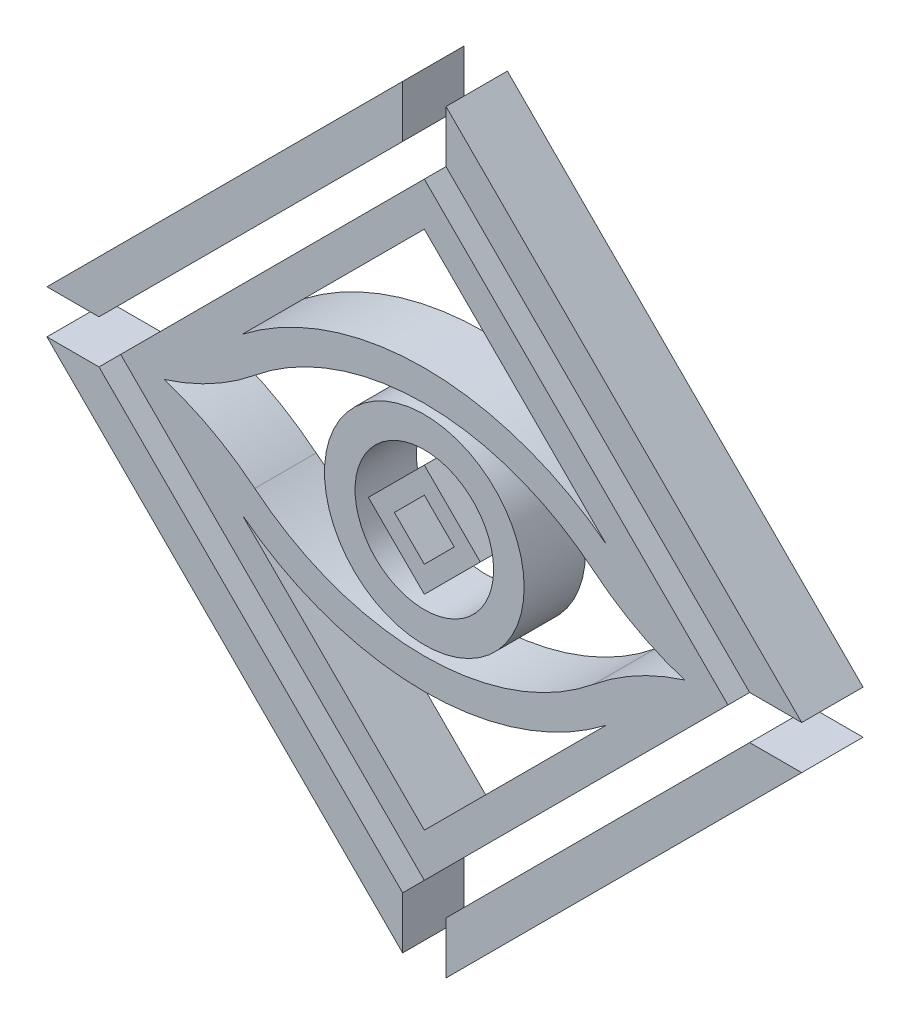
ISO-10303-21;
HEADER;
FILE_DESCRIPTION(('STEP AP214'),'2;1');
FILE_NAME('part.step','',(''),(''),'','','');
FILE_SCHEMA(('AUTOMOTIVE_DESIGN { 1 0 10303 214 1 1 1 1 }'));
ENDSEC;
DATA;
#1=APPLICATION_CONTEXT('core data for automotive mechanical design processes');
#2=APPLICATION_PROTOCOL_DEFINITION('international standard','automotive_design',2000,#1);
#3=PRODUCT_CONTEXT('',#1,'mechanical');
#4=PRODUCT('Part','Part','',(#3));
#5=PRODUCT_RELATED_PRODUCT_CATEGORY('part','',(#4));
#6=PRODUCT_DEFINITION_FORMATION('','',#4);
#7=PRODUCT_DEFINITION_CONTEXT('part definition',#1,'design');
#8=PRODUCT_DEFINITION('design','',#6,#7);
#9=PRODUCT_DEFINITION_SHAPE('','',#8);
#10=(LENGTH_UNIT() NAMED_UNIT(*) SI_UNIT(.MILLI.,.METRE.));
#11=(NAMED_UNIT(*) PLANE_ANGLE_UNIT() SI_UNIT($,.RADIAN.));
#12=(NAMED_UNIT(*) SI_UNIT($,.STERADIAN.) SOLID_ANGLE_UNIT());
#13=UNCERTAINTY_MEASURE_WITH_UNIT(LENGTH_MEASURE(1.E-05),#10,'distance_accuracy_value','');
#14=(GEOMETRIC_REPRESENTATION_CONTEXT(3) GLOBAL_UNCERTAINTY_ASSIGNED_CONTEXT((#13)) GLOBAL_UNIT_ASSIGNED_CONTEXT((#10,
#11,#12)) REPRESENTATION_CONTEXT('',''));
#15=CARTESIAN_POINT('',(0.,0.,0.));
#16=DIRECTION('',(0.,0.,1.));
#17=DIRECTION('',(1.,0.,0.));
#18=AXIS2_PLACEMENT_3D('',#15,#16,#17);
#19=CARTESIAN_POINT('',(61.5182899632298,3.5355339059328,-5.));
#20=DIRECTION('',(0.,-1.,0.));
#21=DIRECTION('',(1.,0.,0.));
#22=AXIS2_PLACEMENT_3D('',#19,#20,#21);
#23=PLANE('',#22);
#24=DIRECTION('',(1.,0.,0.));
#25=VECTOR('',#24,1.);
#26=CARTESIAN_POINT('',(61.5182899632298,3.5355339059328,5.));
#27=LINE('',#26,#25);
#28=CARTESIAN_POINT('',(53.0330085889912,3.53553390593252,5.));
#29=VERTEX_POINT('',#28);
#30=CARTESIAN_POINT('',(61.5182899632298,3.5355339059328,5.));
#31=VERTEX_POINT('',#30);
#32=EDGE_CURVE('E13',#29,#31,#27,.T.);
#33=ORIENTED_EDGE('',*,*,#32,.F.);
#34=DIRECTION('',(0.,0.,1.));
#35=VECTOR('',#34,1.);
#36=CARTESIAN_POINT('',(53.0330085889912,3.53553390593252,-5.));
#37=LINE('',#36,#35);
#38=CARTESIAN_POINT('',(53.0330085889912,3.53553390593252,-5.));
#39=VERTEX_POINT('',#38);
#40=EDGE_CURVE('E166',#39,#29,#37,.T.);
#41=ORIENTED_EDGE('',*,*,#40,.F.);
#42=DIRECTION('',(1.,0.,0.));
#43=VECTOR('',#42,1.);
#44=CARTESIAN_POINT('',(61.5182899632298,3.5355339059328,-5.));
#45=LINE('',#44,#43);
#46=CARTESIAN_POINT('',(61.5182899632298,3.5355339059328,-5.));
#47=VERTEX_POINT('',#46);
#48=EDGE_CURVE('E123',#39,#47,#45,.T.);
#49=ORIENTED_EDGE('',*,*,#48,.T.);
#50=DIRECTION('',(0.,0.,1.));
#51=VECTOR('',#50,1.);
#52=CARTESIAN_POINT('',(61.5182899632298,3.5355339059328,-5.));
#53=LINE('',#52,#51);
#54=EDGE_CURVE('E138',#47,#31,#53,.T.);
#55=ORIENTED_EDGE('',*,*,#54,.T.);
#56=EDGE_LOOP('',(#33,#41,#49,#55));
#57=FACE_BOUND('',#56,.T.);
#58=ADVANCED_FACE('F119',(#57),#23,.T.);
#59=CARTESIAN_POINT('',(53.0330085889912,3.53553390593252,-5.));
#60=DIRECTION('',(-0.707106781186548,-0.707106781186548,0.));
#61=DIRECTION('',(0.707106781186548,-0.707106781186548,0.));
#62=AXIS2_PLACEMENT_3D('',#59,#60,#61);
#63=PLANE('',#62);
#64=DIRECTION('',(0.707106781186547,-0.707106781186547,0.));
#65=VECTOR('',#64,1.);
#66=CARTESIAN_POINT('',(53.0330085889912,3.53553390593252,5.));
#67=LINE('',#66,#65);
#68=CARTESIAN_POINT('',(3.53553390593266,53.0330085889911,5.));
#69=VERTEX_POINT('',#68);
#70=EDGE_CURVE('E179',#69,#29,#67,.T.);
#71=ORIENTED_EDGE('',*,*,#70,.F.);
#72=DIRECTION('',(0.,0.,1.));
#73=VECTOR('',#72,1.);
#74=CARTESIAN_POINT('',(3.53553390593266,53.0330085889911,-5.));
#75=LINE('',#74,#73);
#76=CARTESIAN_POINT('',(3.53553390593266,53.0330085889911,-5.));
#77=VERTEX_POINT('',#76);
#78=EDGE_CURVE('E168',#77,#69,#75,.T.);
#79=ORIENTED_EDGE('',*,*,#78,.F.);
#80=DIRECTION('',(0.707106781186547,-0.707106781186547,0.));
#81=VECTOR('',#80,1.);
#82=CARTESIAN_POINT('',(53.0330085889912,3.53553390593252,-5.));
#83=LINE('',#82,#81);
#84=EDGE_CURVE('E187',#77,#39,#83,.T.);
#85=ORIENTED_EDGE('',*,*,#84,.T.);
#86=ORIENTED_EDGE('',*,*,#40,.T.);
#87=EDGE_LOOP('',(#71,#79,#85,#86));
#88=FACE_BOUND('',#87,.T.);
#89=ADVANCED_FACE('F181',(#88),#63,.T.);
#90=CARTESIAN_POINT('',(3.53553390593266,53.0330085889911,-5.));
#91=DIRECTION('',(-1.,0.,0.));
#92=DIRECTION('',(0.,-1.,0.));
#93=AXIS2_PLACEMENT_3D('',#90,#91,#92);
#94=PLANE('',#93);
#95=DIRECTION('',(0.,-1.,0.));
#96=VECTOR('',#95,1.);
#97=CARTESIAN_POINT('',(3.53553390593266,53.0330085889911,5.));
#98=LINE('',#97,#96);
#99=CARTESIAN_POINT('',(3.53553390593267,61.5182899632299,5.));
#100=VERTEX_POINT('',#99);
#101=EDGE_CURVE('E171',#100,#69,#98,.T.);
#102=ORIENTED_EDGE('',*,*,#101,.F.);
#103=DIRECTION('',(0.,0.,1.));
#104=VECTOR('',#103,1.);
#105=CARTESIAN_POINT('',(3.53553390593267,61.5182899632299,-5.));
#106=LINE('',#105,#104);
#107=CARTESIAN_POINT('',(3.53553390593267,61.5182899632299,-5.));
#108=VERTEX_POINT('',#107);
#109=EDGE_CURVE('E155',#108,#100,#106,.T.);
#110=ORIENTED_EDGE('',*,*,#109,.F.);
#111=DIRECTION('',(0.,-1.,0.));
#112=VECTOR('',#111,1.);
#113=CARTESIAN_POINT('',(3.53553390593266,53.0330085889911,-5.));
#114=LINE('',#113,#112);
#115=EDGE_CURVE('E173',#108,#77,#114,.T.);
#116=ORIENTED_EDGE('',*,*,#115,.T.);
#117=ORIENTED_EDGE('',*,*,#78,.T.);
#118=EDGE_LOOP('',(#102,#110,#116,#117));
#119=FACE_BOUND('',#118,.T.);
#120=ADVANCED_FACE('F170',(#119),#94,.T.);
#121=CARTESIAN_POINT('',(3.53553390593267,61.5182899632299,-5.));
#122=DIRECTION('',(0.707106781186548,0.707106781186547,0.));
#123=DIRECTION('',(-0.707106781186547,0.707106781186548,0.));
#124=AXIS2_PLACEMENT_3D('',#121,#122,#123);
#125=PLANE('',#124);
#126=DIRECTION('',(-0.707106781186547,0.707106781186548,0.));
#127=VECTOR('',#126,1.);
#128=CARTESIAN_POINT('',(3.53553390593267,61.5182899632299,5.));
#129=LINE('',#128,#127);
#130=EDGE_CURVE('E129',#31,#100,#129,.T.);
#131=ORIENTED_EDGE('',*,*,#130,.F.);
#132=ORIENTED_EDGE('',*,*,#54,.F.);
#133=DIRECTION('',(-0.707106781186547,0.707106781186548,0.));
#134=VECTOR('',#133,1.);
#135=CARTESIAN_POINT('',(3.53553390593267,61.5182899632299,-5.));
#136=LINE('',#135,#134);
#137=EDGE_CURVE('E183',#47,#108,#136,.T.);
#138=ORIENTED_EDGE('',*,*,#137,.T.);
#139=ORIENTED_EDGE('',*,*,#109,.T.);
#140=EDGE_LOOP('',(#131,#132,#138,#139));
#141=FACE_BOUND('',#140,.T.);
#142=ADVANCED_FACE('F189',(#141),#125,.T.);
#143=CARTESIAN_POINT('',(0.,0.,-5.));
#144=DIRECTION('',(0.,0.,-1.));
#145=DIRECTION('',(-1.,0.,0.));
#146=AXIS2_PLACEMENT_3D('',#143,#144,#145);
#147=PLANE('',#146);
#148=ORIENTED_EDGE('',*,*,#48,.F.);
#149=ORIENTED_EDGE('',*,*,#84,.F.);
#150=ORIENTED_EDGE('',*,*,#115,.F.);
#151=ORIENTED_EDGE('',*,*,#137,.F.);
#152=EDGE_LOOP('',(#148,#149,#150,#151));
#153=FACE_BOUND('',#152,.T.);
#154=ADVANCED_FACE('F121',(#153),#147,.T.);
#155=CARTESIAN_POINT('',(0.,0.,5.));
#156=DIRECTION('',(0.,0.,-1.));
#157=DIRECTION('',(-1.,0.,0.));
#158=AXIS2_PLACEMENT_3D('',#155,#156,#157);
#159=PLANE('',#158);
#160=ORIENTED_EDGE('',*,*,#32,.T.);
#161=ORIENTED_EDGE('',*,*,#130,.T.);
#162=ORIENTED_EDGE('',*,*,#101,.T.);
#163=ORIENTED_EDGE('',*,*,#70,.T.);
#164=EDGE_LOOP('',(#160,#161,#162,#163));
#165=FACE_BOUND('',#164,.T.);
#166=ADVANCED_FACE('F178',(#165),#159,.F.);
#167=CLOSED_SHELL('',(#58,#89,#120,#142,#154,#166));
#168=MANIFOLD_SOLID_BREP('B2',#167);
#169=CARTESIAN_POINT('',(-3.53553390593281,53.0330085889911,-5.));
#170=DIRECTION('',(1.,0.,0.));
#171=DIRECTION('',(0.,1.,0.));
#172=AXIS2_PLACEMENT_3D('',#169,#170,#171);
#173=PLANE('',#172);
#174=DIRECTION('',(0.,1.,0.));
#175=VECTOR('',#174,1.);
#176=CARTESIAN_POINT('',(-3.53553390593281,53.0330085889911,5.));
#177=LINE('',#176,#175);
#178=CARTESIAN_POINT('',(-3.53553390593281,53.0330085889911,5.));
#179=VERTEX_POINT('',#178);
#180=CARTESIAN_POINT('',(-3.53553390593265,61.5182899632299,5.));
#181=VERTEX_POINT('',#180);
#182=EDGE_CURVE('E117',#179,#181,#177,.T.);
#183=ORIENTED_EDGE('',*,*,#182,.F.);
#184=DIRECTION('',(0.,0.,1.));
#185=VECTOR('',#184,1.);
#186=CARTESIAN_POINT('',(-3.53553390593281,53.0330085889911,-5.));
#187=LINE('',#186,#185);
#188=CARTESIAN_POINT('',(-3.53553390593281,53.0330085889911,-5.));
#189=VERTEX_POINT('',#188);
#190=EDGE_CURVE('E312',#189,#179,#187,.T.);
#191=ORIENTED_EDGE('',*,*,#190,.F.);
#192=DIRECTION('',(0.,1.,0.));
#193=VECTOR('',#192,1.);
#194=CARTESIAN_POINT('',(-3.53553390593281,53.0330085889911,-5.));
#195=LINE('',#194,#193);
#196=CARTESIAN_POINT('',(-3.53553390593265,61.5182899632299,-5.));
#197=VERTEX_POINT('',#196);
#198=EDGE_CURVE('E269',#189,#197,#195,.T.);
#199=ORIENTED_EDGE('',*,*,#198,.T.);
#200=DIRECTION('',(0.,0.,1.));
#201=VECTOR('',#200,1.);
#202=CARTESIAN_POINT('',(-3.53553390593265,61.5182899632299,-5.));
#203=LINE('',#202,#201);
#204=EDGE_CURVE('E284',#197,#181,#203,.T.);
#205=ORIENTED_EDGE('',*,*,#204,.T.);
#206=EDGE_LOOP('',(#183,#191,#199,#205));
#207=FACE_BOUND('',#206,.T.);
#208=ADVANCED_FACE('F265',(#207),#173,.T.);
#209=CARTESIAN_POINT('',(-3.53553390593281,53.0330085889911,-5.));
#210=DIRECTION('',(0.707106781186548,-0.707106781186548,0.));
#211=DIRECTION('',(0.707106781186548,0.707106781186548,0.));
#212=AXIS2_PLACEMENT_3D('',#209,#210,#211);
#213=PLANE('',#212);
#214=DIRECTION('',(0.707106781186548,0.707106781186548,0.));
#215=VECTOR('',#214,1.);
#216=CARTESIAN_POINT('',(-3.53553390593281,53.0330085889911,5.));
#217=LINE('',#216,#215);
#218=CARTESIAN_POINT('',(-53.0330085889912,3.53553390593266,5.));
#219=VERTEX_POINT('',#218);
#220=EDGE_CURVE('E325',#219,#179,#217,.T.);
#221=ORIENTED_EDGE('',*,*,#220,.F.);
#222=DIRECTION('',(0.,0.,1.));
#223=VECTOR('',#222,1.);
#224=CARTESIAN_POINT('',(-53.0330085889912,3.53553390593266,-5.));
#225=LINE('',#224,#223);
#226=CARTESIAN_POINT('',(-53.0330085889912,3.53553390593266,-5.));
#227=VERTEX_POINT('',#226);
#228=EDGE_CURVE('E314',#227,#219,#225,.T.);
#229=ORIENTED_EDGE('',*,*,#228,.F.);
#230=DIRECTION('',(0.707106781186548,0.707106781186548,0.));
#231=VECTOR('',#230,1.);
#232=CARTESIAN_POINT('',(-3.53553390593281,53.0330085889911,-5.));
#233=LINE('',#232,#231);
#234=EDGE_CURVE('E333',#227,#189,#233,.T.);
#235=ORIENTED_EDGE('',*,*,#234,.T.);
#236=ORIENTED_EDGE('',*,*,#190,.T.);
#237=EDGE_LOOP('',(#221,#229,#235,#236));
#238=FACE_BOUND('',#237,.T.);
#239=ADVANCED_FACE('F327',(#238),#213,.T.);
#240=CARTESIAN_POINT('',(-61.5182899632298,3.53553390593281,-5.));
#241=DIRECTION('',(0.,-1.,0.));
#242=DIRECTION('',(1.,0.,0.));
#243=AXIS2_PLACEMENT_3D('',#240,#241,#242);
#244=PLANE('',#243);
#245=DIRECTION('',(1.,0.,0.));
#246=VECTOR('',#245,1.);
#247=CARTESIAN_POINT('',(-61.5182899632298,3.53553390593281,5.));
#248=LINE('',#247,#246);
#249=CARTESIAN_POINT('',(-61.5182899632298,3.53553390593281,5.));
#250=VERTEX_POINT('',#249);
#251=EDGE_CURVE('E317',#250,#219,#248,.T.);
#252=ORIENTED_EDGE('',*,*,#251,.F.);
#253=DIRECTION('',(0.,0.,1.));
#254=VECTOR('',#253,1.);
#255=CARTESIAN_POINT('',(-61.5182899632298,3.53553390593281,-5.));
#256=LINE('',#255,#254);
#257=CARTESIAN_POINT('',(-61.5182899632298,3.53553390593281,-5.));
#258=VERTEX_POINT('',#257);
#259=EDGE_CURVE('E301',#258,#250,#256,.T.);
#260=ORIENTED_EDGE('',*,*,#259,.F.);
#261=DIRECTION('',(1.,0.,0.));
#262=VECTOR('',#261,1.);
#263=CARTESIAN_POINT('',(-61.5182899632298,3.53553390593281,-5.));
#264=LINE('',#263,#262);
#265=EDGE_CURVE('E319',#258,#227,#264,.T.);
#266=ORIENTED_EDGE('',*,*,#265,.T.);
#267=ORIENTED_EDGE('',*,*,#228,.T.);
#268=EDGE_LOOP('',(#252,#260,#266,#267));
#269=FACE_BOUND('',#268,.T.);
#270=ADVANCED_FACE('F316',(#269),#244,.T.);
#271=CARTESIAN_POINT('',(-3.53553390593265,61.5182899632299,-5.));
#272=DIRECTION('',(-0.707106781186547,0.707106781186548,0.));
#273=DIRECTION('',(-0.707106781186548,-0.707106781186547,0.));
#274=AXIS2_PLACEMENT_3D('',#271,#272,#273);
#275=PLANE('',#274);
#276=DIRECTION('',(-0.707106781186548,-0.707106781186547,0.));
#277=VECTOR('',#276,1.);
#278=CARTESIAN_POINT('',(-3.53553390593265,61.5182899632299,5.));
#279=LINE('',#278,#277);
#280=EDGE_CURVE('E275',#181,#250,#279,.T.);
#281=ORIENTED_EDGE('',*,*,#280,.F.);
#282=ORIENTED_EDGE('',*,*,#204,.F.);
#283=DIRECTION('',(-0.707106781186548,-0.707106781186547,0.));
#284=VECTOR('',#283,1.);
#285=CARTESIAN_POINT('',(-3.53553390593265,61.5182899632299,-5.));
#286=LINE('',#285,#284);
#287=EDGE_CURVE('E329',#197,#258,#286,.T.);
#288=ORIENTED_EDGE('',*,*,#287,.T.);
#289=ORIENTED_EDGE('',*,*,#259,.T.);
#290=EDGE_LOOP('',(#281,#282,#288,#289));
#291=FACE_BOUND('',#290,.T.);
#292=ADVANCED_FACE('F335',(#291),#275,.T.);
#293=CARTESIAN_POINT('',(0.,0.,-5.));
#294=DIRECTION('',(0.,0.,-1.));
#295=DIRECTION('',(-1.,0.,0.));
#296=AXIS2_PLACEMENT_3D('',#293,#294,#295);
#297=PLANE('',#296);
#298=ORIENTED_EDGE('',*,*,#198,.F.);
#299=ORIENTED_EDGE('',*,*,#234,.F.);
#300=ORIENTED_EDGE('',*,*,#265,.F.);
#301=ORIENTED_EDGE('',*,*,#287,.F.);
#302=EDGE_LOOP('',(#298,#299,#300,#301));
#303=FACE_BOUND('',#302,.T.);
#304=ADVANCED_FACE('F267',(#303),#297,.T.);
#305=CARTESIAN_POINT('',(0.,0.,5.));
#306=DIRECTION('',(0.,0.,-1.));
#307=DIRECTION('',(-1.,0.,0.));
#308=AXIS2_PLACEMENT_3D('',#305,#306,#307);
#309=PLANE('',#308);
#310=ORIENTED_EDGE('',*,*,#182,.T.);
#311=ORIENTED_EDGE('',*,*,#280,.T.);
#312=ORIENTED_EDGE('',*,*,#251,.T.);
#313=ORIENTED_EDGE('',*,*,#220,.T.);
#314=EDGE_LOOP('',(#310,#311,#312,#313));
#315=FACE_BOUND('',#314,.T.);
#316=ADVANCED_FACE('F324',(#315),#309,.F.);
#317=CLOSED_SHELL('',(#208,#239,#270,#292,#304,#316));
#318=MANIFOLD_SOLID_BREP('B7',#317);
#319=CARTESIAN_POINT('',(3.53553390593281,-53.0330085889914,-5.));
#320=DIRECTION('',(-1.,0.,0.));
#321=DIRECTION('',(0.,-1.,0.));
#322=AXIS2_PLACEMENT_3D('',#319,#320,#321);
#323=PLANE('',#322);
#324=DIRECTION('',(0.,-1.,0.));
#325=VECTOR('',#324,1.);
#326=CARTESIAN_POINT('',(3.53553390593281,-53.0330085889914,5.));
#327=LINE('',#326,#325);
#328=CARTESIAN_POINT('',(3.53553390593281,-53.0330085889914,5.));
#329=VERTEX_POINT('',#328);
#330=CARTESIAN_POINT('',(3.53553390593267,-61.5182899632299,5.));
#331=VERTEX_POINT('',#330);
#332=EDGE_CURVE('E263',#329,#331,#327,.T.);
#333=ORIENTED_EDGE('',*,*,#332,.F.);
#334=DIRECTION('',(0.,0.,1.));
#335=VECTOR('',#334,1.);
#336=CARTESIAN_POINT('',(3.53553390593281,-53.0330085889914,-5.));
#337=LINE('',#336,#335);
#338=CARTESIAN_POINT('',(3.53553390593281,-53.0330085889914,-5.));
#339=VERTEX_POINT('',#338);
#340=EDGE_CURVE('E458',#339,#329,#337,.T.);
#341=ORIENTED_EDGE('',*,*,#340,.F.);
#342=DIRECTION('',(0.,-1.,0.));
#343=VECTOR('',#342,1.);
#344=CARTESIAN_POINT('',(3.53553390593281,-53.0330085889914,-5.));
#345=LINE('',#344,#343);
#346=CARTESIAN_POINT('',(3.53553390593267,-61.5182899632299,-5.));
#347=VERTEX_POINT('',#346);
#348=EDGE_CURVE('E415',#339,#347,#345,.T.);
#349=ORIENTED_EDGE('',*,*,#348,.T.);
#350=DIRECTION('',(0.,0.,1.));
#351=VECTOR('',#350,1.);
#352=CARTESIAN_POINT('',(3.53553390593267,-61.5182899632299,-5.));
#353=LINE('',#352,#351);
#354=EDGE_CURVE('E430',#347,#331,#353,.T.);
#355=ORIENTED_EDGE('',*,*,#354,.T.);
#356=EDGE_LOOP('',(#333,#341,#349,#355));
#357=FACE_BOUND('',#356,.T.);
#358=ADVANCED_FACE('F411',(#357),#323,.T.);
#359=CARTESIAN_POINT('',(3.53553390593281,-53.0330085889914,-5.));
#360=DIRECTION('',(-0.707106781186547,0.707106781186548,0.));
#361=DIRECTION('',(-0.707106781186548,-0.707106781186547,0.));
#362=AXIS2_PLACEMENT_3D('',#359,#360,#361);
#363=PLANE('',#362);
#364=DIRECTION('',(-0.707106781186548,-0.707106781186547,0.));
#365=VECTOR('',#364,1.);
#366=CARTESIAN_POINT('',(3.53553390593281,-53.0330085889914,5.));
#367=LINE('',#366,#365);
#368=CARTESIAN_POINT('',(53.0330085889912,-3.53553390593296,5.));
#369=VERTEX_POINT('',#368);
#370=EDGE_CURVE('E471',#369,#329,#367,.T.);
#371=ORIENTED_EDGE('',*,*,#370,.F.);
#372=DIRECTION('',(0.,0.,1.));
#373=VECTOR('',#372,1.);
#374=CARTESIAN_POINT('',(53.0330085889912,-3.53553390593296,-5.));
#375=LINE('',#374,#373);
#376=CARTESIAN_POINT('',(53.0330085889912,-3.53553390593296,-5.));
#377=VERTEX_POINT('',#376);
#378=EDGE_CURVE('E460',#377,#369,#375,.T.);
#379=ORIENTED_EDGE('',*,*,#378,.F.);
#380=DIRECTION('',(-0.707106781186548,-0.707106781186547,0.));
#381=VECTOR('',#380,1.);
#382=CARTESIAN_POINT('',(3.53553390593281,-53.0330085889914,-5.));
#383=LINE('',#382,#381);
#384=EDGE_CURVE('E479',#377,#339,#383,.T.);
#385=ORIENTED_EDGE('',*,*,#384,.T.);
#386=ORIENTED_EDGE('',*,*,#340,.T.);
#387=EDGE_LOOP('',(#371,#379,#385,#386));
#388=FACE_BOUND('',#387,.T.);
#389=ADVANCED_FACE('F473',(#388),#363,.T.);
#390=CARTESIAN_POINT('',(61.5182899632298,-3.5355339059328,-5.));
#391=DIRECTION('',(0.,1.,0.));
#392=DIRECTION('',(-1.,0.,0.));
#393=AXIS2_PLACEMENT_3D('',#390,#391,#392);
#394=PLANE('',#393);
#395=DIRECTION('',(-1.,0.,0.));
#396=VECTOR('',#395,1.);
#397=CARTESIAN_POINT('',(61.5182899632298,-3.5355339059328,5.));
#398=LINE('',#397,#396);
#399=CARTESIAN_POINT('',(61.5182899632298,-3.5355339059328,5.));
#400=VERTEX_POINT('',#399);
#401=EDGE_CURVE('E463',#400,#369,#398,.T.);
#402=ORIENTED_EDGE('',*,*,#401,.F.);
#403=DIRECTION('',(0.,0.,1.));
#404=VECTOR('',#403,1.);
#405=CARTESIAN_POINT('',(61.5182899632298,-3.5355339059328,-5.));
#406=LINE('',#405,#404);
#407=CARTESIAN_POINT('',(61.5182899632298,-3.5355339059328,-5.));
#408=VERTEX_POINT('',#407);
#409=EDGE_CURVE('E447',#408,#400,#406,.T.);
#410=ORIENTED_EDGE('',*,*,#409,.F.);
#411=DIRECTION('',(-1.,0.,0.));
#412=VECTOR('',#411,1.);
#413=CARTESIAN_POINT('',(61.5182899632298,-3.5355339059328,-5.));
#414=LINE('',#413,#412);
#415=EDGE_CURVE('E465',#408,#377,#414,.T.);
#416=ORIENTED_EDGE('',*,*,#415,.T.);
#417=ORIENTED_EDGE('',*,*,#378,.T.);
#418=EDGE_LOOP('',(#402,#410,#416,#417));
#419=FACE_BOUND('',#418,.T.);
#420=ADVANCED_FACE('F462',(#419),#394,.T.);
#421=CARTESIAN_POINT('',(3.53553390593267,-61.5182899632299,-5.));
#422=DIRECTION('',(0.707106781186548,-0.707106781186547,0.));
#423=DIRECTION('',(0.707106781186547,0.707106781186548,0.));
#424=AXIS2_PLACEMENT_3D('',#421,#422,#423);
#425=PLANE('',#424);
#426=DIRECTION('',(0.707106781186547,0.707106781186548,0.));
#427=VECTOR('',#426,1.);
#428=CARTESIAN_POINT('',(3.53553390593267,-61.5182899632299,5.));
#429=LINE('',#428,#427);
#430=EDGE_CURVE('E421',#331,#400,#429,.T.);
#431=ORIENTED_EDGE('',*,*,#430,.F.);
#432=ORIENTED_EDGE('',*,*,#354,.F.);
#433=DIRECTION('',(0.707106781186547,0.707106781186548,0.));
#434=VECTOR('',#433,1.);
#435=CARTESIAN_POINT('',(3.53553390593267,-61.5182899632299,-5.));
#436=LINE('',#435,#434);
#437=EDGE_CURVE('E475',#347,#408,#436,.T.);
#438=ORIENTED_EDGE('',*,*,#437,.T.);
#439=ORIENTED_EDGE('',*,*,#409,.T.);
#440=EDGE_LOOP('',(#431,#432,#438,#439));
#441=FACE_BOUND('',#440,.T.);
#442=ADVANCED_FACE('F481',(#441),#425,.T.);
#443=CARTESIAN_POINT('',(0.,0.,-5.));
#444=DIRECTION('',(0.,0.,-1.));
#445=DIRECTION('',(-1.,0.,0.));
#446=AXIS2_PLACEMENT_3D('',#443,#444,#445);
#447=PLANE('',#446);
#448=ORIENTED_EDGE('',*,*,#348,.F.);
#449=ORIENTED_EDGE('',*,*,#384,.F.);
#450=ORIENTED_EDGE('',*,*,#415,.F.);
#451=ORIENTED_EDGE('',*,*,#437,.F.);
#452=EDGE_LOOP('',(#448,#449,#450,#451));
#453=FACE_BOUND('',#452,.T.);
#454=ADVANCED_FACE('F413',(#453),#447,.T.);
#455=CARTESIAN_POINT('',(0.,0.,5.));
#456=DIRECTION('',(0.,0.,-1.));
#457=DIRECTION('',(-1.,0.,0.));
#458=AXIS2_PLACEMENT_3D('',#455,#456,#457);
#459=PLANE('',#458);
#460=ORIENTED_EDGE('',*,*,#332,.T.);
#461=ORIENTED_EDGE('',*,*,#430,.T.);
#462=ORIENTED_EDGE('',*,*,#401,.T.);
#463=ORIENTED_EDGE('',*,*,#370,.T.);
#464=EDGE_LOOP('',(#460,#461,#462,#463));
#465=FACE_BOUND('',#464,.T.);
#466=ADVANCED_FACE('F470',(#465),#459,.F.);
#467=CLOSED_SHELL('',(#358,#389,#420,#442,#454,#466));
#468=MANIFOLD_SOLID_BREP('B111',#467);
#469=CARTESIAN_POINT('',(-61.5182899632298,-3.53553390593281,-5.));
#470=DIRECTION('',(0.,1.,0.));
#471=DIRECTION('',(0.,0.,1.));
#472=AXIS2_PLACEMENT_3D('',#469,#470,#471);
#473=PLANE('',#472);
#474=DIRECTION('',(-1.,0.,0.));
#475=VECTOR('',#474,1.);
#476=CARTESIAN_POINT('',(-61.5182899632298,-3.53553390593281,5.));
#477=LINE('',#476,#475);
#478=CARTESIAN_POINT('',(-53.0330085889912,-3.53553390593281,5.));
#479=VERTEX_POINT('',#478);
#480=CARTESIAN_POINT('',(-61.5182899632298,-3.53553390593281,5.));
#481=VERTEX_POINT('',#480);
#482=EDGE_CURVE('E621',#479,#481,#477,.T.);
#483=ORIENTED_EDGE('',*,*,#482,.F.);
#484=DIRECTION('',(0.,0.,1.));
#485=VECTOR('',#484,1.);
#486=CARTESIAN_POINT('',(-53.0330085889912,-3.53553390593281,-5.));
#487=LINE('',#486,#485);
#488=CARTESIAN_POINT('',(-53.0330085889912,-3.53553390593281,-5.));
#489=VERTEX_POINT('',#488);
#490=EDGE_CURVE('E409',#489,#479,#487,.T.);
#491=ORIENTED_EDGE('',*,*,#490,.F.);
#492=DIRECTION('',(-1.,0.,0.));
#493=VECTOR('',#492,1.);
#494=CARTESIAN_POINT('',(-61.5182899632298,-3.53553390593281,-5.));
#495=LINE('',#494,#493);
#496=CARTESIAN_POINT('',(-61.5182899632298,-3.53553390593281,-5.));
#497=VERTEX_POINT('',#496);
#498=EDGE_CURVE('E615',#489,#497,#495,.T.);
#499=ORIENTED_EDGE('',*,*,#498,.T.);
#500=DIRECTION('',(0.,0.,1.));
#501=VECTOR('',#500,1.);
#502=CARTESIAN_POINT('',(-61.5182899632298,-3.53553390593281,-5.));
#503=LINE('',#502,#501);
#504=EDGE_CURVE('E560',#497,#481,#503,.T.);
#505=ORIENTED_EDGE('',*,*,#504,.T.);
#506=EDGE_LOOP('',(#483,#491,#499,#505));
#507=FACE_BOUND('',#506,.T.);
#508=ADVANCED_FACE('F557',(#507),#473,.T.);
#509=CARTESIAN_POINT('',(-53.0330085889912,-3.53553390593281,-5.));
#510=DIRECTION('',(0.707106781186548,0.707106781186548,0.));
#511=DIRECTION('',(-0.707106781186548,0.707106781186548,0.));
#512=AXIS2_PLACEMENT_3D('',#509,#510,#511);
#513=PLANE('',#512);
#514=DIRECTION('',(-0.707106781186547,0.707106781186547,0.));
#515=VECTOR('',#514,1.);
#516=CARTESIAN_POINT('',(-53.0330085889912,-3.53553390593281,5.));
#517=LINE('',#516,#515);
#518=CARTESIAN_POINT('',(-3.53553390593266,-53.0330085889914,5.));
#519=VERTEX_POINT('',#518);
#520=EDGE_CURVE('E617',#519,#479,#517,.T.);
#521=ORIENTED_EDGE('',*,*,#520,.F.);
#522=DIRECTION('',(0.,0.,1.));
#523=VECTOR('',#522,1.);
#524=CARTESIAN_POINT('',(-3.53553390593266,-53.0330085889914,-5.));
#525=LINE('',#524,#523);
#526=CARTESIAN_POINT('',(-3.53553390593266,-53.0330085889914,-5.));
#527=VERTEX_POINT('',#526);
#528=EDGE_CURVE('E566',#527,#519,#525,.T.);
#529=ORIENTED_EDGE('',*,*,#528,.F.);
#530=DIRECTION('',(-0.707106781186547,0.707106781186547,0.));
#531=VECTOR('',#530,1.);
#532=CARTESIAN_POINT('',(-53.0330085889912,-3.53553390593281,-5.));
#533=LINE('',#532,#531);
#534=EDGE_CURVE('E612',#527,#489,#533,.T.);
#535=ORIENTED_EDGE('',*,*,#534,.T.);
#536=ORIENTED_EDGE('',*,*,#490,.T.);
#537=EDGE_LOOP('',(#521,#529,#535,#536));
#538=FACE_BOUND('',#537,.T.);
#539=ADVANCED_FACE('F631',(#538),#513,.T.);
#540=CARTESIAN_POINT('',(-3.53553390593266,-53.0330085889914,-5.));
#541=DIRECTION('',(1.,0.,0.));
#542=DIRECTION('',(0.,1.,0.));
#543=AXIS2_PLACEMENT_3D('',#540,#541,#542);
#544=PLANE('',#543);
#545=DIRECTION('',(0.,1.,0.));
#546=VECTOR('',#545,1.);
#547=CARTESIAN_POINT('',(-3.53553390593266,-53.0330085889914,5.));
#548=LINE('',#547,#546);
#549=CARTESIAN_POINT('',(-3.53553390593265,-61.5182899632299,5.));
#550=VERTEX_POINT('',#549);
#551=EDGE_CURVE('E607',#550,#519,#548,.T.);
#552=ORIENTED_EDGE('',*,*,#551,.F.);
#553=DIRECTION('',(0.,0.,1.));
#554=VECTOR('',#553,1.);
#555=CARTESIAN_POINT('',(-3.53553390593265,-61.5182899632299,-5.));
#556=LINE('',#555,#554);
#557=CARTESIAN_POINT('',(-3.53553390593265,-61.5182899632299,-5.));
#558=VERTEX_POINT('',#557);
#559=EDGE_CURVE('E602',#558,#550,#556,.T.);
#560=ORIENTED_EDGE('',*,*,#559,.F.);
#561=DIRECTION('',(0.,1.,0.));
#562=VECTOR('',#561,1.);
#563=CARTESIAN_POINT('',(-3.53553390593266,-53.0330085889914,-5.));
#564=LINE('',#563,#562);
#565=EDGE_CURVE('E605',#558,#527,#564,.T.);
#566=ORIENTED_EDGE('',*,*,#565,.T.);
#567=ORIENTED_EDGE('',*,*,#528,.T.);
#568=EDGE_LOOP('',(#552,#560,#566,#567));
#569=FACE_BOUND('',#568,.T.);
#570=ADVANCED_FACE('F604',(#569),#544,.T.);
#571=CARTESIAN_POINT('',(-3.53553390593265,-61.5182899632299,-5.));
#572=DIRECTION('',(-0.707106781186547,-0.707106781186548,0.));
#573=DIRECTION('',(0.707106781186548,-0.707106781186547,0.));
#574=AXIS2_PLACEMENT_3D('',#571,#572,#573);
#575=PLANE('',#574);
#576=DIRECTION('',(0.707106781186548,-0.707106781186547,0.));
#577=VECTOR('',#576,1.);
#578=CARTESIAN_POINT('',(-3.53553390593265,-61.5182899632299,5.));
#579=LINE('',#578,#577);
#580=EDGE_CURVE('E624',#481,#550,#579,.T.);
#581=ORIENTED_EDGE('',*,*,#580,.F.);
#582=ORIENTED_EDGE('',*,*,#504,.F.);
#583=DIRECTION('',(0.707106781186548,-0.707106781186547,0.));
#584=VECTOR('',#583,1.);
#585=CARTESIAN_POINT('',(-3.53553390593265,-61.5182899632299,-5.));
#586=LINE('',#585,#584);
#587=EDGE_CURVE('E611',#497,#558,#586,.T.);
#588=ORIENTED_EDGE('',*,*,#587,.T.);
#589=ORIENTED_EDGE('',*,*,#559,.T.);
#590=EDGE_LOOP('',(#581,#582,#588,#589));
#591=FACE_BOUND('',#590,.T.);
#592=ADVANCED_FACE('F614',(#591),#575,.T.);
#593=CARTESIAN_POINT('',(0.,0.,-5.));
#594=DIRECTION('',(0.,0.,-1.));
#595=DIRECTION('',(-1.,0.,0.));
#596=AXIS2_PLACEMENT_3D('',#593,#594,#595);
#597=PLANE('',#596);
#598=ORIENTED_EDGE('',*,*,#498,.F.);
#599=ORIENTED_EDGE('',*,*,#534,.F.);
#600=ORIENTED_EDGE('',*,*,#565,.F.);
#601=ORIENTED_EDGE('',*,*,#587,.F.);
#602=EDGE_LOOP('',(#598,#599,#600,#601));
#603=FACE_BOUND('',#602,.T.);
#604=ADVANCED_FACE('F610',(#603),#597,.T.);
#605=CARTESIAN_POINT('',(0.,0.,5.));
#606=DIRECTION('',(0.,0.,-1.));
#607=DIRECTION('',(-1.,0.,0.));
#608=AXIS2_PLACEMENT_3D('',#605,#606,#607);
#609=PLANE('',#608);
#610=ORIENTED_EDGE('',*,*,#482,.T.);
#611=ORIENTED_EDGE('',*,*,#580,.T.);
#612=ORIENTED_EDGE('',*,*,#551,.T.);
#613=ORIENTED_EDGE('',*,*,#520,.T.);
#614=EDGE_LOOP('',(#610,#611,#612,#613));
#615=FACE_BOUND('',#614,.T.);
#616=ADVANCED_FACE('F630',(#615),#609,.F.);
#617=CLOSED_SHELL('',(#508,#539,#570,#592,#604,#616));
#618=MANIFOLD_SOLID_BREP('B257',#617);
#619=CARTESIAN_POINT('',(-4.56096500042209,-4.56096500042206,5.));
#620=DIRECTION('',(0.70710678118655,0.707106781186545,0.));
#621=DIRECTION('',(-0.707106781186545,0.70710678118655,0.));
#622=AXIS2_PLACEMENT_3D('',#619,#620,#621);
#623=PLANE('',#622);
#624=DIRECTION('',(0.707106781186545,-0.70710678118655,0.));
#625=VECTOR('',#624,1.);
#626=CARTESIAN_POINT('',(-4.56096500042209,-4.56096500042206,-5.));
#627=LINE('',#626,#625);
#628=CARTESIAN_POINT('',(-9.12193000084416,0.,-5.));
#629=VERTEX_POINT('',#628);
#630=CARTESIAN_POINT('',(0.,-9.12193000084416,-5.));
#631=VERTEX_POINT('',#630);
#632=EDGE_CURVE('E814',#629,#631,#627,.T.);
#633=ORIENTED_EDGE('',*,*,#632,.T.);
#634=DIRECTION('',(0.,0.,-1.));
#635=VECTOR('',#634,1.);
#636=CARTESIAN_POINT('',(0.,-9.12193000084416,5.));
#637=LINE('',#636,#635);
#638=CARTESIAN_POINT('',(0.,-9.12193000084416,5.));
#639=VERTEX_POINT('',#638);
#640=EDGE_CURVE('E555',#639,#631,#637,.T.);
#641=ORIENTED_EDGE('',*,*,#640,.F.);
#642=DIRECTION('',(0.707106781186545,-0.70710678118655,0.));
#643=VECTOR('',#642,1.);
#644=CARTESIAN_POINT('',(-4.56096500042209,-4.56096500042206,5.));
#645=LINE('',#644,#643);
#646=CARTESIAN_POINT('',(-9.12193000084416,0.,5.));
#647=VERTEX_POINT('',#646);
#648=EDGE_CURVE('E818',#647,#639,#645,.T.);
#649=ORIENTED_EDGE('',*,*,#648,.F.);
#650=DIRECTION('',(0.,0.,-1.));
#651=VECTOR('',#650,1.);
#652=CARTESIAN_POINT('',(-9.12193000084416,0.,5.));
#653=LINE('',#652,#651);
#654=EDGE_CURVE('E824',#647,#629,#653,.T.);
#655=ORIENTED_EDGE('',*,*,#654,.T.);
#656=EDGE_LOOP('',(#633,#641,#649,#655));
#657=FACE_BOUND('',#656,.T.);
#658=ADVANCED_FACE('F701',(#657),#623,.F.);
#659=CARTESIAN_POINT('',(4.56096500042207,-4.56096500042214,5.));
#660=DIRECTION('',(-0.707106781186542,0.707106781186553,0.));
#661=DIRECTION('',(-0.707106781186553,-0.707106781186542,0.));
#662=AXIS2_PLACEMENT_3D('',#659,#660,#661);
#663=PLANE('',#662);
#664=DIRECTION('',(0.707106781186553,0.707106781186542,0.));
#665=VECTOR('',#664,1.);
#666=CARTESIAN_POINT('',(4.56096500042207,-4.56096500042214,-5.));
#667=LINE('',#666,#665);
#668=CARTESIAN_POINT('',(9.12193000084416,-1.16226472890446E-13,-5.));
#669=VERTEX_POINT('',#668);
#670=EDGE_CURVE('E827',#631,#669,#667,.T.);
#671=ORIENTED_EDGE('',*,*,#670,.T.);
#672=DIRECTION('',(0.,0.,-1.));
#673=VECTOR('',#672,1.);
#674=CARTESIAN_POINT('',(9.12193000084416,-1.16226472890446E-13,5.));
#675=LINE('',#674,#673);
#676=CARTESIAN_POINT('',(9.12193000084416,-1.16226472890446E-13,5.));
#677=VERTEX_POINT('',#676);
#678=EDGE_CURVE('E709',#677,#669,#675,.T.);
#679=ORIENTED_EDGE('',*,*,#678,.F.);
#680=DIRECTION('',(0.707106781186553,0.707106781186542,0.));
#681=VECTOR('',#680,1.);
#682=CARTESIAN_POINT('',(4.56096500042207,-4.56096500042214,5.));
#683=LINE('',#682,#681);
#684=EDGE_CURVE('E748',#639,#677,#683,.T.);
#685=ORIENTED_EDGE('',*,*,#684,.F.);
#686=ORIENTED_EDGE('',*,*,#640,.T.);
#687=EDGE_LOOP('',(#671,#679,#685,#686));
#688=FACE_BOUND('',#687,.T.);
#689=ADVANCED_FACE('F849',(#688),#663,.F.);
#690=CARTESIAN_POINT('',(4.56096500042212,4.56096500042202,5.));
#691=DIRECTION('',(-0.707106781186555,-0.70710678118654,0.));
#692=DIRECTION('',(0.70710678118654,-0.707106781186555,0.));
#693=AXIS2_PLACEMENT_3D('',#690,#691,#692);
#694=PLANE('',#693);
#695=DIRECTION('',(-0.70710678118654,0.707106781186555,0.));
#696=VECTOR('',#695,1.);
#697=CARTESIAN_POINT('',(4.56096500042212,4.56096500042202,-5.));
#698=LINE('',#697,#696);
#699=CARTESIAN_POINT('',(0.,9.12193000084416,-5.));
#700=VERTEX_POINT('',#699);
#701=EDGE_CURVE('E735',#669,#700,#698,.T.);
#702=ORIENTED_EDGE('',*,*,#701,.T.);
#703=DIRECTION('',(0.,0.,-1.));
#704=VECTOR('',#703,1.);
#705=CARTESIAN_POINT('',(0.,9.12193000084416,5.));
#706=LINE('',#705,#704);
#707=CARTESIAN_POINT('',(0.,9.12193000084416,5.));
#708=VERTEX_POINT('',#707);
#709=EDGE_CURVE('E832',#708,#700,#706,.T.);
#710=ORIENTED_EDGE('',*,*,#709,.F.);
#711=DIRECTION('',(-0.70710678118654,0.707106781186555,0.));
#712=VECTOR('',#711,1.);
#713=CARTESIAN_POINT('',(4.56096500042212,4.56096500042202,5.));
#714=LINE('',#713,#712);
#715=EDGE_CURVE('E821',#677,#708,#714,.T.);
#716=ORIENTED_EDGE('',*,*,#715,.F.);
#717=ORIENTED_EDGE('',*,*,#678,.T.);
#718=EDGE_LOOP('',(#702,#710,#716,#717));
#719=FACE_BOUND('',#718,.T.);
#720=ADVANCED_FACE('F834',(#719),#694,.F.);
#721=CARTESIAN_POINT('',(-4.56096500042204,4.56096500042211,5.));
#722=DIRECTION('',(0.707106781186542,-0.707106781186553,0.));
#723=DIRECTION('',(0.707106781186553,0.707106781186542,0.));
#724=AXIS2_PLACEMENT_3D('',#721,#722,#723);
#725=PLANE('',#724);
#726=DIRECTION('',(-0.707106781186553,-0.707106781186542,0.));
#727=VECTOR('',#726,1.);
#728=CARTESIAN_POINT('',(-4.56096500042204,4.56096500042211,-5.));
#729=LINE('',#728,#727);
#730=EDGE_CURVE('E741',#700,#629,#729,.T.);
#731=ORIENTED_EDGE('',*,*,#730,.T.);
#732=ORIENTED_EDGE('',*,*,#654,.F.);
#733=DIRECTION('',(-0.707106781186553,-0.707106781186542,0.));
#734=VECTOR('',#733,1.);
#735=CARTESIAN_POINT('',(-4.56096500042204,4.56096500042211,5.));
#736=LINE('',#735,#734);
#737=EDGE_CURVE('E717',#708,#647,#736,.T.);
#738=ORIENTED_EDGE('',*,*,#737,.F.);
#739=ORIENTED_EDGE('',*,*,#709,.T.);
#740=EDGE_LOOP('',(#731,#732,#738,#739));
#741=FACE_BOUND('',#740,.T.);
#742=ADVANCED_FACE('F840',(#741),#725,.F.);
#743=CARTESIAN_POINT('',(0.,0.,5.));
#744=DIRECTION('',(0.,0.,1.));
#745=DIRECTION('',(1.,0.,0.));
#746=AXIS2_PLACEMENT_3D('',#743,#744,#745);
#747=PLANE('',#746);
#748=ORIENTED_EDGE('',*,*,#648,.T.);
#749=ORIENTED_EDGE('',*,*,#684,.T.);
#750=ORIENTED_EDGE('',*,*,#715,.T.);
#751=ORIENTED_EDGE('',*,*,#737,.T.);
#752=EDGE_LOOP('',(#748,#749,#750,#751));
#753=FACE_BOUND('',#752,.T.);
#754=DIRECTION('',(-0.707106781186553,-0.707106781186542,0.));
#755=VECTOR('',#754,1.);
#756=CARTESIAN_POINT('',(2.43964465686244,-2.43964465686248,5.));
#757=LINE('',#756,#755);
#758=CARTESIAN_POINT('',(4.87928931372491,0.,5.));
#759=VERTEX_POINT('',#758);
#760=CARTESIAN_POINT('',(0.,-4.87928931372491,5.));
#761=VERTEX_POINT('',#760);
#762=EDGE_CURVE('E808',#759,#761,#757,.T.);
#763=ORIENTED_EDGE('',*,*,#762,.T.);
#764=DIRECTION('',(-0.707106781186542,0.707106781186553,0.));
#765=VECTOR('',#764,1.);
#766=CARTESIAN_POINT('',(-2.43964465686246,-2.43964465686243,5.));
#767=LINE('',#766,#765);
#768=CARTESIAN_POINT('',(-4.87928931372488,0.,5.));
#769=VERTEX_POINT('',#768);
#770=EDGE_CURVE('E780',#761,#769,#767,.T.);
#771=ORIENTED_EDGE('',*,*,#770,.T.);
#772=DIRECTION('',(0.707106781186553,0.707106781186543,0.));
#773=VECTOR('',#772,1.);
#774=CARTESIAN_POINT('',(-2.43964465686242,2.43964465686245,5.));
#775=LINE('',#774,#773);
#776=CARTESIAN_POINT('',(0.,4.87928931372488,5.));
#777=VERTEX_POINT('',#776);
#778=EDGE_CURVE('E803',#769,#777,#775,.T.);
#779=ORIENTED_EDGE('',*,*,#778,.T.);
#780=DIRECTION('',(0.707106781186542,-0.707106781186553,0.));
#781=VECTOR('',#780,1.);
#782=CARTESIAN_POINT('',(2.43964465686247,2.43964465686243,5.));
#783=LINE('',#782,#781);
#784=EDGE_CURVE('E800',#777,#759,#783,.T.);
#785=ORIENTED_EDGE('',*,*,#784,.T.);
#786=EDGE_LOOP('',(#763,#771,#779,#785));
#787=FACE_BOUND('',#786,.T.);
#788=ADVANCED_FACE('F842',(#753,#787),#747,.T.);
#789=CARTESIAN_POINT('',(0.,0.,-5.));
#790=DIRECTION('',(0.,0.,1.));
#791=DIRECTION('',(1.,0.,0.));
#792=AXIS2_PLACEMENT_3D('',#789,#790,#791);
#793=PLANE('',#792);
#794=ORIENTED_EDGE('',*,*,#632,.F.);
#795=ORIENTED_EDGE('',*,*,#730,.F.);
#796=ORIENTED_EDGE('',*,*,#701,.F.);
#797=ORIENTED_EDGE('',*,*,#670,.F.);
#798=EDGE_LOOP('',(#794,#795,#796,#797));
#799=FACE_BOUND('',#798,.T.);
#800=DIRECTION('',(-0.707106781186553,-0.707106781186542,0.));
#801=VECTOR('',#800,1.);
#802=CARTESIAN_POINT('',(2.43964465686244,-2.43964465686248,-5.));
#803=LINE('',#802,#801);
#804=CARTESIAN_POINT('',(4.87928931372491,0.,-5.));
#805=VERTEX_POINT('',#804);
#806=CARTESIAN_POINT('',(0.,-4.87928931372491,-5.));
#807=VERTEX_POINT('',#806);
#808=EDGE_CURVE('E793',#805,#807,#803,.T.);
#809=ORIENTED_EDGE('',*,*,#808,.F.);
#810=DIRECTION('',(0.707106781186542,-0.707106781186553,0.));
#811=VECTOR('',#810,1.);
#812=CARTESIAN_POINT('',(2.43964465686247,2.43964465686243,-5.));
#813=LINE('',#812,#811);
#814=CARTESIAN_POINT('',(0.,4.87928931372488,-5.));
#815=VERTEX_POINT('',#814);
#816=EDGE_CURVE('E786',#815,#805,#813,.T.);
#817=ORIENTED_EDGE('',*,*,#816,.F.);
#818=DIRECTION('',(0.707106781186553,0.707106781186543,0.));
#819=VECTOR('',#818,1.);
#820=CARTESIAN_POINT('',(-2.43964465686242,2.43964465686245,-5.));
#821=LINE('',#820,#819);
#822=CARTESIAN_POINT('',(-4.87928931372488,0.,-5.));
#823=VERTEX_POINT('',#822);
#824=EDGE_CURVE('E796',#823,#815,#821,.T.);
#825=ORIENTED_EDGE('',*,*,#824,.F.);
#826=DIRECTION('',(-0.707106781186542,0.707106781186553,0.));
#827=VECTOR('',#826,1.);
#828=CARTESIAN_POINT('',(-2.43964465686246,-2.43964465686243,-5.));
#829=LINE('',#828,#827);
#830=EDGE_CURVE('E778',#807,#823,#829,.T.);
#831=ORIENTED_EDGE('',*,*,#830,.F.);
#832=EDGE_LOOP('',(#809,#817,#825,#831));
#833=FACE_BOUND('',#832,.T.);
#834=ADVANCED_FACE('F791',(#799,#833),#793,.F.);
#835=CARTESIAN_POINT('',(2.43964465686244,-2.43964465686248,-5.));
#836=DIRECTION('',(-0.707106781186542,0.707106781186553,0.));
#837=DIRECTION('',(-0.707106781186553,-0.707106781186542,0.));
#838=AXIS2_PLACEMENT_3D('',#835,#836,#837);
#839=PLANE('',#838);
#840=ORIENTED_EDGE('',*,*,#762,.F.);
#841=DIRECTION('',(0.,0.,1.));
#842=VECTOR('',#841,1.);
#843=CARTESIAN_POINT('',(4.87928931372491,0.,-5.));
#844=LINE('',#843,#842);
#845=EDGE_CURVE('E799',#805,#759,#844,.T.);
#846=ORIENTED_EDGE('',*,*,#845,.F.);
#847=ORIENTED_EDGE('',*,*,#808,.T.);
#848=DIRECTION('',(0.,0.,1.));
#849=VECTOR('',#848,1.);
#850=CARTESIAN_POINT('',(0.,-4.87928931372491,-5.));
#851=LINE('',#850,#849);
#852=EDGE_CURVE('E775',#807,#761,#851,.T.);
#853=ORIENTED_EDGE('',*,*,#852,.T.);
#854=EDGE_LOOP('',(#840,#846,#847,#853));
#855=FACE_BOUND('',#854,.T.);
#856=ADVANCED_FACE('F798',(#855),#839,.T.);
#857=CARTESIAN_POINT('',(2.43964465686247,2.43964465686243,-5.));
#858=DIRECTION('',(-0.707106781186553,-0.707106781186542,0.));
#859=DIRECTION('',(0.707106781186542,-0.707106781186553,0.));
#860=AXIS2_PLACEMENT_3D('',#857,#858,#859);
#861=PLANE('',#860);
#862=ORIENTED_EDGE('',*,*,#784,.F.);
#863=DIRECTION('',(0.,0.,1.));
#864=VECTOR('',#863,1.);
#865=CARTESIAN_POINT('',(0.,4.87928931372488,-5.));
#866=LINE('',#865,#864);
#867=EDGE_CURVE('E815',#815,#777,#866,.T.);
#868=ORIENTED_EDGE('',*,*,#867,.F.);
#869=ORIENTED_EDGE('',*,*,#816,.T.);
#870=ORIENTED_EDGE('',*,*,#845,.T.);
#871=EDGE_LOOP('',(#862,#868,#869,#870));
#872=FACE_BOUND('',#871,.T.);
#873=ADVANCED_FACE('F892',(#872),#861,.T.);
#874=CARTESIAN_POINT('',(-2.43964465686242,2.43964465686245,-5.));
#875=DIRECTION('',(0.707106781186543,-0.707106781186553,0.));
#876=DIRECTION('',(0.707106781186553,0.707106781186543,0.));
#877=AXIS2_PLACEMENT_3D('',#874,#875,#876);
#878=PLANE('',#877);
#879=ORIENTED_EDGE('',*,*,#778,.F.);
#880=DIRECTION('',(0.,0.,1.));
#881=VECTOR('',#880,1.);
#882=CARTESIAN_POINT('',(-4.87928931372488,0.,-5.));
#883=LINE('',#882,#881);
#884=EDGE_CURVE('E785',#823,#769,#883,.T.);
#885=ORIENTED_EDGE('',*,*,#884,.F.);
#886=ORIENTED_EDGE('',*,*,#824,.T.);
#887=ORIENTED_EDGE('',*,*,#867,.T.);
#888=EDGE_LOOP('',(#879,#885,#886,#887));
#889=FACE_BOUND('',#888,.T.);
#890=ADVANCED_FACE('F902',(#889),#878,.T.);
#891=CARTESIAN_POINT('',(-2.43964465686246,-2.43964465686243,-5.));
#892=DIRECTION('',(0.707106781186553,0.707106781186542,0.));
#893=DIRECTION('',(-0.707106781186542,0.707106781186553,0.));
#894=AXIS2_PLACEMENT_3D('',#891,#892,#893);
#895=PLANE('',#894);
#896=ORIENTED_EDGE('',*,*,#770,.F.);
#897=ORIENTED_EDGE('',*,*,#852,.F.);
#898=ORIENTED_EDGE('',*,*,#830,.T.);
#899=ORIENTED_EDGE('',*,*,#884,.T.);
#900=EDGE_LOOP('',(#896,#897,#898,#899));
#901=FACE_BOUND('',#900,.T.);
#902=ADVANCED_FACE('F777',(#901),#895,.T.);
#903=CLOSED_SHELL('',(#658,#689,#720,#742,#788,#834,#856,#873,#890,#902));
#904=MANIFOLD_SOLID_BREP('B403',#903);
#905=CARTESIAN_POINT('',(0.,0.,5.));
#906=DIRECTION('',(0.,0.,-1.));
#907=DIRECTION('',(-1.,0.,0.));
#908=AXIS2_PLACEMENT_3D('',#905,#906,#907);
#909=CYLINDRICAL_SURFACE('',#908,11.2927601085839);
#910=CARTESIAN_POINT('',(0.,0.,5.));
#911=DIRECTION('',(0.,0.,1.));
#912=DIRECTION('',(1.,0.,0.));
#913=AXIS2_PLACEMENT_3D('',#910,#911,#912);
#914=CIRCLE('',#913,11.2927601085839);
#915=CARTESIAN_POINT('',(11.2927601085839,0.,5.));
#916=VERTEX_POINT('',#915);
#917=EDGE_CURVE('E700',#916,#916,#914,.T.);
#918=ORIENTED_EDGE('',*,*,#917,.T.);
#919=EDGE_LOOP('',(#918));
#920=FACE_BOUND('',#919,.T.);
#921=CARTESIAN_POINT('',(0.,0.,-5.));
#922=DIRECTION('',(0.,0.,1.));
#923=DIRECTION('',(1.,0.,0.));
#924=AXIS2_PLACEMENT_3D('',#921,#922,#923);
#925=CIRCLE('',#924,11.2927601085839);
#926=CARTESIAN_POINT('',(11.2927601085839,0.,-5.));
#927=VERTEX_POINT('',#926);
#928=EDGE_CURVE('E969',#927,#927,#925,.T.);
#929=ORIENTED_EDGE('',*,*,#928,.F.);
#930=EDGE_LOOP('',(#929));
#931=FACE_BOUND('',#930,.T.);
#932=ADVANCED_FACE('F966',(#920,#931),#909,.F.);
#933=CARTESIAN_POINT('',(0.,0.,5.));
#934=DIRECTION('',(0.,0.,1.));
#935=DIRECTION('',(1.,0.,0.));
#936=AXIS2_PLACEMENT_3D('',#933,#934,#935);
#937=PLANE('',#936);
#938=ORIENTED_EDGE('',*,*,#917,.F.);
#939=EDGE_LOOP('',(#938));
#940=FACE_BOUND('',#939,.T.);
#941=CARTESIAN_POINT('',(0.,0.,5.));
#942=DIRECTION('',(0.,0.,1.));
#943=DIRECTION('',(1.,0.,0.));
#944=AXIS2_PLACEMENT_3D('',#941,#942,#943);
#945=CIRCLE('',#944,16.2731615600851);
#946=CARTESIAN_POINT('',(16.2731615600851,0.,5.));
#947=VERTEX_POINT('',#946);
#948=EDGE_CURVE('E978',#947,#947,#945,.T.);
#949=ORIENTED_EDGE('',*,*,#948,.T.);
#950=EDGE_LOOP('',(#949));
#951=FACE_BOUND('',#950,.T.);
#952=ADVANCED_FACE('F989',(#940,#951),#937,.T.);
#953=CARTESIAN_POINT('',(0.,0.,-5.));
#954=DIRECTION('',(0.,0.,1.));
#955=DIRECTION('',(1.,0.,0.));
#956=AXIS2_PLACEMENT_3D('',#953,#954,#955);
#957=PLANE('',#956);
#958=ORIENTED_EDGE('',*,*,#928,.T.);
#959=EDGE_LOOP('',(#958));
#960=FACE_BOUND('',#959,.T.);
#961=CARTESIAN_POINT('',(0.,0.,-5.));
#962=DIRECTION('',(0.,0.,1.));
#963=DIRECTION('',(1.,0.,0.));
#964=AXIS2_PLACEMENT_3D('',#961,#962,#963);
#965=CIRCLE('',#964,16.2731615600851);
#966=CARTESIAN_POINT('',(16.2731615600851,0.,-5.));
#967=VERTEX_POINT('',#966);
#968=EDGE_CURVE('E976',#967,#967,#965,.T.);
#969=ORIENTED_EDGE('',*,*,#968,.F.);
#970=EDGE_LOOP('',(#969));
#971=FACE_BOUND('',#970,.T.);
#972=ADVANCED_FACE('F987',(#960,#971),#957,.F.);
#973=CARTESIAN_POINT('',(0.,0.,-5.));
#974=DIRECTION('',(0.,0.,1.));
#975=DIRECTION('',(1.,0.,0.));
#976=AXIS2_PLACEMENT_3D('',#973,#974,#975);
#977=CYLINDRICAL_SURFACE('',#976,16.2731615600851);
#978=ORIENTED_EDGE('',*,*,#968,.T.);
#979=EDGE_LOOP('',(#978));
#980=FACE_BOUND('',#979,.T.);
#981=ORIENTED_EDGE('',*,*,#948,.F.);
#982=EDGE_LOOP('',(#981));
#983=FACE_BOUND('',#982,.T.);
#984=ADVANCED_FACE('F984',(#980,#983),#977,.T.);
#985=CLOSED_SHELL('',(#932,#952,#972,#984));
#986=MANIFOLD_SOLID_BREP('B549',#985);
#987=CARTESIAN_POINT('',(-21.2132034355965,-21.2132034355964,5.));
#988=DIRECTION('',(0.70710678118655,0.707106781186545,0.));
#989=DIRECTION('',(-0.707106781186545,0.70710678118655,0.));
#990=AXIS2_PLACEMENT_3D('',#987,#988,#989);
#991=PLANE('',#990);
#992=DIRECTION('',(0.,0.,1.));
#993=VECTOR('',#992,1.);
#994=CARTESIAN_POINT('',(-29.657517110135,-12.7688897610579,-5.));
#995=LINE('',#994,#993);
#996=CARTESIAN_POINT('',(-29.657517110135,-12.7688897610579,5.));
#997=VERTEX_POINT('',#996);
#998=CARTESIAN_POINT('',(-29.657517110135,-12.7688897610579,-5.));
#999=VERTEX_POINT('',#998);
#1000=EDGE_CURVE('E1067',#997,#999,#995,.F.);
#1001=ORIENTED_EDGE('',*,*,#1000,.F.);
#1002=DIRECTION('',(0.707106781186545,-0.70710678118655,0.));
#1003=VECTOR('',#1002,1.);
#1004=CARTESIAN_POINT('',(-21.2132034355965,-21.2132034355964,5.));
#1005=LINE('',#1004,#1003);
#1006=CARTESIAN_POINT('',(0.,-42.4264068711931,5.));
#1007=VERTEX_POINT('',#1006);
#1008=EDGE_CURVE('E1211',#997,#1007,#1005,.T.);
#1009=ORIENTED_EDGE('',*,*,#1008,.T.);
#1010=DIRECTION('',(0.,0.,-1.));
#1011=VECTOR('',#1010,1.);
#1012=CARTESIAN_POINT('',(0.,-42.4264068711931,5.));
#1013=LINE('',#1012,#1011);
#1014=CARTESIAN_POINT('',(0.,-42.4264068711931,-5.));
#1015=VERTEX_POINT('',#1014);
#1016=EDGE_CURVE('E964',#1007,#1015,#1013,.T.);
#1017=ORIENTED_EDGE('',*,*,#1016,.T.);
#1018=DIRECTION('',(0.707106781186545,-0.70710678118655,0.));
#1019=VECTOR('',#1018,1.);
#1020=CARTESIAN_POINT('',(-21.2132034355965,-21.2132034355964,-5.));
#1021=LINE('',#1020,#1019);
#1022=EDGE_CURVE('E1245',#999,#1015,#1021,.T.);
#1023=ORIENTED_EDGE('',*,*,#1022,.F.);
#1024=EDGE_LOOP('',(#1001,#1009,#1017,#1023));
#1025=FACE_BOUND('',#1024,.T.);
#1026=ADVANCED_FACE('F1042',(#1025),#991,.T.);
#1027=CARTESIAN_POINT('',(24.7487373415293,-24.7487373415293,5.));
#1028=DIRECTION('',(-0.707106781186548,0.707106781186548,0.));
#1029=DIRECTION('',(-0.707106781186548,-0.707106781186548,0.));
#1030=AXIS2_PLACEMENT_3D('',#1027,#1028,#1029);
#1031=PLANE('',#1030);
#1032=DIRECTION('',(0.707106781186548,0.707106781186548,0.));
#1033=VECTOR('',#1032,1.);
#1034=CARTESIAN_POINT('',(24.7487373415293,-24.7487373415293,-5.));
#1035=LINE('',#1034,#1033);
#1036=CARTESIAN_POINT('',(0.,-49.4974746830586,-5.));
#1037=VERTEX_POINT('',#1036);
#1038=CARTESIAN_POINT('',(49.4974746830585,-2.15105711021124E-13,-5.));
#1039=VERTEX_POINT('',#1038);
#1040=EDGE_CURVE('E1236',#1037,#1039,#1035,.T.);
#1041=ORIENTED_EDGE('',*,*,#1040,.T.);
#1042=DIRECTION('',(0.,0.,-1.));
#1043=VECTOR('',#1042,1.);
#1044=CARTESIAN_POINT('',(49.4974746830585,-2.15105711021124E-13,5.));
#1045=LINE('',#1044,#1043);
#1046=CARTESIAN_POINT('',(49.4974746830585,-2.15105711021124E-13,5.));
#1047=VERTEX_POINT('',#1046);
#1048=EDGE_CURVE('E1051',#1047,#1039,#1045,.T.);
#1049=ORIENTED_EDGE('',*,*,#1048,.F.);
#1050=DIRECTION('',(0.707106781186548,0.707106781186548,0.));
#1051=VECTOR('',#1050,1.);
#1052=CARTESIAN_POINT('',(24.7487373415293,-24.7487373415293,5.));
#1053=LINE('',#1052,#1051);
#1054=CARTESIAN_POINT('',(0.,-49.4974746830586,5.));
#1055=VERTEX_POINT('',#1054);
#1056=EDGE_CURVE('E1202',#1055,#1047,#1053,.T.);
#1057=ORIENTED_EDGE('',*,*,#1056,.F.);
#1058=DIRECTION('',(0.,0.,-1.));
#1059=VECTOR('',#1058,1.);
#1060=CARTESIAN_POINT('',(0.,-49.4974746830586,5.));
#1061=LINE('',#1060,#1059);
#1062=EDGE_CURVE('E1249',#1055,#1037,#1061,.T.);
#1063=ORIENTED_EDGE('',*,*,#1062,.T.);
#1064=EDGE_LOOP('',(#1041,#1049,#1057,#1063));
#1065=FACE_BOUND('',#1064,.T.);
#1066=ADVANCED_FACE('F1309',(#1065),#1031,.F.);
#1067=CARTESIAN_POINT('',(24.7487373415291,24.7487373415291,5.));
#1068=DIRECTION('',(-0.707106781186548,-0.707106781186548,0.));
#1069=DIRECTION('',(0.707106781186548,-0.707106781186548,0.));
#1070=AXIS2_PLACEMENT_3D('',#1067,#1068,#1069);
#1071=PLANE('',#1070);
#1072=DIRECTION('',(-0.707106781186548,0.707106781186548,0.));
#1073=VECTOR('',#1072,1.);
#1074=CARTESIAN_POINT('',(24.7487373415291,24.7487373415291,-5.));
#1075=LINE('',#1074,#1073);
#1076=CARTESIAN_POINT('',(0.,49.4974746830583,-5.));
#1077=VERTEX_POINT('',#1076);
#1078=EDGE_CURVE('E1239',#1039,#1077,#1075,.T.);
#1079=ORIENTED_EDGE('',*,*,#1078,.T.);
#1080=DIRECTION('',(0.,0.,-1.));
#1081=VECTOR('',#1080,1.);
#1082=CARTESIAN_POINT('',(0.,49.4974746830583,5.));
#1083=LINE('',#1082,#1081);
#1084=CARTESIAN_POINT('',(0.,49.4974746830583,5.));
#1085=VERTEX_POINT('',#1084);
#1086=EDGE_CURVE('E1256',#1085,#1077,#1083,.T.);
#1087=ORIENTED_EDGE('',*,*,#1086,.F.);
#1088=DIRECTION('',(-0.707106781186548,0.707106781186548,0.));
#1089=VECTOR('',#1088,1.);
#1090=CARTESIAN_POINT('',(24.7487373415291,24.7487373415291,5.));
#1091=LINE('',#1090,#1089);
#1092=EDGE_CURVE('E1205',#1047,#1085,#1091,.T.);
#1093=ORIENTED_EDGE('',*,*,#1092,.F.);
#1094=ORIENTED_EDGE('',*,*,#1048,.T.);
#1095=EDGE_LOOP('',(#1079,#1087,#1093,#1094));
#1096=FACE_BOUND('',#1095,.T.);
#1097=ADVANCED_FACE('F1314',(#1096),#1071,.F.);
#1098=CARTESIAN_POINT('',(-24.7487373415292,24.7487373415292,5.));
#1099=DIRECTION('',(0.707106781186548,-0.707106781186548,0.));
#1100=DIRECTION('',(0.707106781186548,0.707106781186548,0.));
#1101=AXIS2_PLACEMENT_3D('',#1098,#1099,#1100);
#1102=PLANE('',#1101);
#1103=DIRECTION('',(-0.707106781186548,-0.707106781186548,0.));
#1104=VECTOR('',#1103,1.);
#1105=CARTESIAN_POINT('',(-24.7487373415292,24.7487373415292,-5.));
#1106=LINE('',#1105,#1104);
#1107=CARTESIAN_POINT('',(-49.4974746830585,0.,-5.));
#1108=VERTEX_POINT('',#1107);
#1109=EDGE_CURVE('E1241',#1077,#1108,#1106,.T.);
#1110=ORIENTED_EDGE('',*,*,#1109,.T.);
#1111=DIRECTION('',(0.,0.,-1.));
#1112=VECTOR('',#1111,1.);
#1113=CARTESIAN_POINT('',(-49.4974746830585,0.,5.));
#1114=LINE('',#1113,#1112);
#1115=CARTESIAN_POINT('',(-49.4974746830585,0.,5.));
#1116=VERTEX_POINT('',#1115);
#1117=EDGE_CURVE('E1252',#1116,#1108,#1114,.T.);
#1118=ORIENTED_EDGE('',*,*,#1117,.F.);
#1119=DIRECTION('',(-0.707106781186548,-0.707106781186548,0.));
#1120=VECTOR('',#1119,1.);
#1121=CARTESIAN_POINT('',(-24.7487373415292,24.7487373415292,5.));
#1122=LINE('',#1121,#1120);
#1123=EDGE_CURVE('E1207',#1085,#1116,#1122,.T.);
#1124=ORIENTED_EDGE('',*,*,#1123,.F.);
#1125=ORIENTED_EDGE('',*,*,#1086,.T.);
#1126=EDGE_LOOP('',(#1110,#1118,#1124,#1125));
#1127=FACE_BOUND('',#1126,.T.);
#1128=ADVANCED_FACE('F1325',(#1127),#1102,.F.);
#1129=CARTESIAN_POINT('',(0.,25.8238929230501,5.));
#1130=DIRECTION('',(0.,0.,-1.));
#1131=DIRECTION('',(-1.,0.,0.));
#1132=AXIS2_PLACEMENT_3D('',#1129,#1130,#1131);
#1133=CYLINDRICAL_SURFACE('',#1132,43.6720782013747);
#1134=CARTESIAN_POINT('',(0.,25.8238929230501,-5.));
#1135=DIRECTION('',(0.,0.,1.));
#1136=DIRECTION('',(1.,0.,0.));
#1137=AXIS2_PLACEMENT_3D('',#1134,#1135,#1136);
#1138=CIRCLE('',#1137,43.6720782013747);
#1139=CARTESIAN_POINT('',(-27.6392125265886,-7.98918657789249,-5.));
#1140=VERTEX_POINT('',#1139);
#1141=CARTESIAN_POINT('',(27.6392125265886,-7.98918657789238,-5.));
#1142=VERTEX_POINT('',#1141);
#1143=EDGE_CURVE('E1218',#1140,#1142,#1138,.T.);
#1144=ORIENTED_EDGE('',*,*,#1143,.F.);
#1145=DIRECTION('',(0.,0.,-1.));
#1146=VECTOR('',#1145,1.);
#1147=CARTESIAN_POINT('',(-27.6392125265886,-7.98918657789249,5.));
#1148=LINE('',#1147,#1146);
#1149=CARTESIAN_POINT('',(-27.6392125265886,-7.98918657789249,5.));
#1150=VERTEX_POINT('',#1149);
#1151=EDGE_CURVE('E1253',#1150,#1140,#1148,.T.);
#1152=ORIENTED_EDGE('',*,*,#1151,.F.);
#1153=CARTESIAN_POINT('',(0.,25.8238929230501,5.));
#1154=DIRECTION('',(0.,0.,1.));
#1155=DIRECTION('',(1.,0.,0.));
#1156=AXIS2_PLACEMENT_3D('',#1153,#1154,#1155);
#1157=CIRCLE('',#1156,43.6720782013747);
#1158=CARTESIAN_POINT('',(27.6392125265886,-7.98918657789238,5.));
#1159=VERTEX_POINT('',#1158);
#1160=EDGE_CURVE('E1181',#1150,#1159,#1157,.T.);
#1161=ORIENTED_EDGE('',*,*,#1160,.T.);
#1162=DIRECTION('',(0.,0.,-1.));
#1163=VECTOR('',#1162,1.);
#1164=CARTESIAN_POINT('',(27.6392125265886,-7.98918657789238,5.));
#1165=LINE('',#1164,#1163);
#1166=EDGE_CURVE('E1261',#1159,#1142,#1165,.T.);
#1167=ORIENTED_EDGE('',*,*,#1166,.T.);
#1168=EDGE_LOOP('',(#1144,#1152,#1161,#1167));
#1169=FACE_BOUND('',#1168,.T.);
#1170=ADVANCED_FACE('F1278',(#1169),#1133,.F.);
#1171=CARTESIAN_POINT('',(-55.8123310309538,-42.4554324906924,5.));
#1172=DIRECTION('',(0.,0.,-1.));
#1173=DIRECTION('',(-1.,0.,0.));
#1174=AXIS2_PLACEMENT_3D('',#1171,#1172,#1173);
#1175=CYLINDRICAL_SURFACE('',#1174,44.5156906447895);
#1176=CARTESIAN_POINT('',(-55.8123310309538,-42.4554324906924,-5.));
#1177=DIRECTION('',(0.,0.,1.));
#1178=DIRECTION('',(1.,0.,0.));
#1179=AXIS2_PLACEMENT_3D('',#1176,#1177,#1178);
#1180=CIRCLE('',#1179,44.5156906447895);
#1181=CARTESIAN_POINT('',(-42.4264068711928,-1.59594559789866E-13,-5.));
#1182=VERTEX_POINT('',#1181);
#1183=EDGE_CURVE('E1221',#1182,#1140,#1180,.F.);
#1184=ORIENTED_EDGE('',*,*,#1183,.F.);
#1185=DIRECTION('',(0.,0.,-1.));
#1186=VECTOR('',#1185,1.);
#1187=CARTESIAN_POINT('',(-42.4264068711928,-1.59594559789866E-13,5.));
#1188=LINE('',#1187,#1186);
#1189=CARTESIAN_POINT('',(-42.4264068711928,-1.59594559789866E-13,5.));
#1190=VERTEX_POINT('',#1189);
#1191=EDGE_CURVE('E1270',#1190,#1182,#1188,.T.);
#1192=ORIENTED_EDGE('',*,*,#1191,.F.);
#1193=CARTESIAN_POINT('',(-55.8123310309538,-42.4554324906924,5.));
#1194=DIRECTION('',(0.,0.,1.));
#1195=DIRECTION('',(1.,0.,0.));
#1196=AXIS2_PLACEMENT_3D('',#1193,#1194,#1195);
#1197=CIRCLE('',#1196,44.5156906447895);
#1198=EDGE_CURVE('E1184',#1190,#1150,#1197,.F.);
#1199=ORIENTED_EDGE('',*,*,#1198,.T.);
#1200=ORIENTED_EDGE('',*,*,#1151,.T.);
#1201=EDGE_LOOP('',(#1184,#1192,#1199,#1200));
#1202=FACE_BOUND('',#1201,.T.);
#1203=ADVANCED_FACE('F1274',(#1202),#1175,.T.);
#1204=CARTESIAN_POINT('',(-55.8123310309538,42.4554324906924,5.));
#1205=DIRECTION('',(0.,0.,-1.));
#1206=DIRECTION('',(-1.,0.,0.));
#1207=AXIS2_PLACEMENT_3D('',#1204,#1205,#1206);
#1208=CYLINDRICAL_SURFACE('',#1207,44.5156906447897);
#1209=CARTESIAN_POINT('',(-55.8123310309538,42.4554324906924,-5.));
#1210=DIRECTION('',(0.,0.,1.));
#1211=DIRECTION('',(1.,0.,0.));
#1212=AXIS2_PLACEMENT_3D('',#1209,#1210,#1211);
#1213=CIRCLE('',#1212,44.5156906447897);
#1214=CARTESIAN_POINT('',(-27.6392125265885,7.98918657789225,-5.));
#1215=VERTEX_POINT('',#1214);
#1216=EDGE_CURVE('E1224',#1182,#1215,#1213,.T.);
#1217=ORIENTED_EDGE('',*,*,#1216,.T.);
#1218=DIRECTION('',(0.,0.,-1.));
#1219=VECTOR('',#1218,1.);
#1220=CARTESIAN_POINT('',(-27.6392125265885,7.98918657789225,5.));
#1221=LINE('',#1220,#1219);
#1222=CARTESIAN_POINT('',(-27.6392125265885,7.98918657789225,5.));
#1223=VERTEX_POINT('',#1222);
#1224=EDGE_CURVE('E1267',#1223,#1215,#1221,.T.);
#1225=ORIENTED_EDGE('',*,*,#1224,.F.);
#1226=CARTESIAN_POINT('',(-55.8123310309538,42.4554324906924,5.));
#1227=DIRECTION('',(0.,0.,1.));
#1228=DIRECTION('',(1.,0.,0.));
#1229=AXIS2_PLACEMENT_3D('',#1226,#1227,#1228);
#1230=CIRCLE('',#1229,44.5156906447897);
#1231=EDGE_CURVE('E1192',#1190,#1223,#1230,.T.);
#1232=ORIENTED_EDGE('',*,*,#1231,.F.);
#1233=ORIENTED_EDGE('',*,*,#1191,.T.);
#1234=EDGE_LOOP('',(#1217,#1225,#1232,#1233));
#1235=FACE_BOUND('',#1234,.T.);
#1236=ADVANCED_FACE('F1287',(#1235),#1208,.T.);
#1237=CARTESIAN_POINT('',(0.,-25.8238929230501,5.));
#1238=DIRECTION('',(0.,0.,-1.));
#1239=DIRECTION('',(-1.,0.,0.));
#1240=AXIS2_PLACEMENT_3D('',#1237,#1238,#1239);
#1241=CYLINDRICAL_SURFACE('',#1240,43.6720782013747);
#1242=CARTESIAN_POINT('',(0.,-25.8238929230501,-5.));
#1243=DIRECTION('',(0.,0.,1.));
#1244=DIRECTION('',(1.,0.,0.));
#1245=AXIS2_PLACEMENT_3D('',#1242,#1243,#1244);
#1246=CIRCLE('',#1245,43.6720782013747);
#1247=CARTESIAN_POINT('',(27.6392125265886,7.98918657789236,-5.));
#1248=VERTEX_POINT('',#1247);
#1249=EDGE_CURVE('E1227',#1215,#1248,#1246,.F.);
#1250=ORIENTED_EDGE('',*,*,#1249,.T.);
#1251=DIRECTION('',(0.,0.,-1.));
#1252=VECTOR('',#1251,1.);
#1253=CARTESIAN_POINT('',(27.6392125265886,7.98918657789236,5.));
#1254=LINE('',#1253,#1252);
#1255=CARTESIAN_POINT('',(27.6392125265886,7.98918657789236,5.));
#1256=VERTEX_POINT('',#1255);
#1257=EDGE_CURVE('E1265',#1256,#1248,#1254,.T.);
#1258=ORIENTED_EDGE('',*,*,#1257,.F.);
#1259=CARTESIAN_POINT('',(0.,-25.8238929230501,5.));
#1260=DIRECTION('',(0.,0.,1.));
#1261=DIRECTION('',(1.,0.,0.));
#1262=AXIS2_PLACEMENT_3D('',#1259,#1260,#1261);
#1263=CIRCLE('',#1262,43.6720782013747);
#1264=EDGE_CURVE('E1195',#1223,#1256,#1263,.F.);
#1265=ORIENTED_EDGE('',*,*,#1264,.F.);
#1266=ORIENTED_EDGE('',*,*,#1224,.T.);
#1267=EDGE_LOOP('',(#1250,#1258,#1265,#1266));
#1268=FACE_BOUND('',#1267,.T.);
#1269=ADVANCED_FACE('F1299',(#1268),#1241,.F.);
#1270=CARTESIAN_POINT('',(55.8123310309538,42.4554324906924,5.));
#1271=DIRECTION('',(0.,0.,-1.));
#1272=DIRECTION('',(-1.,0.,0.));
#1273=AXIS2_PLACEMENT_3D('',#1270,#1271,#1272);
#1274=CYLINDRICAL_SURFACE('',#1273,44.5156906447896);
#1275=CARTESIAN_POINT('',(55.8123310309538,42.4554324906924,-5.));
#1276=DIRECTION('',(0.,0.,1.));
#1277=DIRECTION('',(1.,0.,0.));
#1278=AXIS2_PLACEMENT_3D('',#1275,#1276,#1277);
#1279=CIRCLE('',#1278,44.5156906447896);
#1280=CARTESIAN_POINT('',(42.4264068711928,0.,-5.));
#1281=VERTEX_POINT('',#1280);
#1282=EDGE_CURVE('E1230',#1281,#1248,#1279,.F.);
#1283=ORIENTED_EDGE('',*,*,#1282,.F.);
#1284=DIRECTION('',(0.,0.,-1.));
#1285=VECTOR('',#1284,1.);
#1286=CARTESIAN_POINT('',(42.4264068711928,0.,5.));
#1287=LINE('',#1286,#1285);
#1288=CARTESIAN_POINT('',(42.4264068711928,0.,5.));
#1289=VERTEX_POINT('',#1288);
#1290=EDGE_CURVE('E1263',#1289,#1281,#1287,.T.);
#1291=ORIENTED_EDGE('',*,*,#1290,.F.);
#1292=CARTESIAN_POINT('',(55.8123310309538,42.4554324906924,5.));
#1293=DIRECTION('',(0.,0.,1.));
#1294=DIRECTION('',(1.,0.,0.));
#1295=AXIS2_PLACEMENT_3D('',#1292,#1293,#1294);
#1296=CIRCLE('',#1295,44.5156906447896);
#1297=EDGE_CURVE('E1197',#1289,#1256,#1296,.F.);
#1298=ORIENTED_EDGE('',*,*,#1297,.T.);
#1299=ORIENTED_EDGE('',*,*,#1257,.T.);
#1300=EDGE_LOOP('',(#1283,#1291,#1298,#1299));
#1301=FACE_BOUND('',#1300,.T.);
#1302=ADVANCED_FACE('F1296',(#1301),#1274,.T.);
#1303=CARTESIAN_POINT('',(-21.2132034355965,21.2132034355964,5.));
#1304=DIRECTION('',(0.707106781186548,-0.707106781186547,0.));
#1305=DIRECTION('',(0.707106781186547,0.707106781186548,0.));
#1306=AXIS2_PLACEMENT_3D('',#1303,#1304,#1305);
#1307=PLANE('',#1306);
#1308=DIRECTION('',(0.,0.,1.));
#1309=VECTOR('',#1308,1.);
#1310=CARTESIAN_POINT('',(-29.6575171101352,12.7688897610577,-5.));
#1311=LINE('',#1310,#1309);
#1312=CARTESIAN_POINT('',(-29.6575171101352,12.7688897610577,-5.));
#1313=VERTEX_POINT('',#1312);
#1314=CARTESIAN_POINT('',(-29.6575171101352,12.7688897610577,5.));
#1315=VERTEX_POINT('',#1314);
#1316=EDGE_CURVE('E1163',#1313,#1315,#1311,.T.);
#1317=ORIENTED_EDGE('',*,*,#1316,.F.);
#1318=DIRECTION('',(-0.707106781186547,-0.707106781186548,0.));
#1319=VECTOR('',#1318,1.);
#1320=CARTESIAN_POINT('',(-21.2132034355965,21.2132034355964,-5.));
#1321=LINE('',#1320,#1319);
#1322=CARTESIAN_POINT('',(-1.42247325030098E-13,42.4264068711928,-5.));
#1323=VERTEX_POINT('',#1322);
#1324=EDGE_CURVE('E1214',#1323,#1313,#1321,.T.);
#1325=ORIENTED_EDGE('',*,*,#1324,.F.);
#1326=DIRECTION('',(0.,0.,-1.));
#1327=VECTOR('',#1326,1.);
#1328=CARTESIAN_POINT('',(-1.42247325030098E-13,42.4264068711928,5.));
#1329=LINE('',#1328,#1327);
#1330=CARTESIAN_POINT('',(-1.42247325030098E-13,42.4264068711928,5.));
#1331=VERTEX_POINT('',#1330);
#1332=EDGE_CURVE('E1046',#1331,#1323,#1329,.T.);
#1333=ORIENTED_EDGE('',*,*,#1332,.F.);
#1334=DIRECTION('',(-0.707106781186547,-0.707106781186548,0.));
#1335=VECTOR('',#1334,1.);
#1336=CARTESIAN_POINT('',(-21.2132034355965,21.2132034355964,5.));
#1337=LINE('',#1336,#1335);
#1338=EDGE_CURVE('E1180',#1331,#1315,#1337,.T.);
#1339=ORIENTED_EDGE('',*,*,#1338,.T.);
#1340=EDGE_LOOP('',(#1317,#1325,#1333,#1339));
#1341=FACE_BOUND('',#1340,.T.);
#1342=ADVANCED_FACE('F1044',(#1341),#1307,.T.);
#1343=CARTESIAN_POINT('',(21.2132034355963,21.2132034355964,5.));
#1344=DIRECTION('',(-0.707106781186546,-0.70710678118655,0.));
#1345=DIRECTION('',(0.70710678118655,-0.707106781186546,0.));
#1346=AXIS2_PLACEMENT_3D('',#1343,#1344,#1345);
#1347=PLANE('',#1346);
#1348=DIRECTION('',(0.,0.,1.));
#1349=VECTOR('',#1348,1.);
#1350=CARTESIAN_POINT('',(29.6575171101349,12.7688897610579,-5.));
#1351=LINE('',#1350,#1349);
#1352=CARTESIAN_POINT('',(29.6575171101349,12.7688897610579,5.));
#1353=VERTEX_POINT('',#1352);
#1354=CARTESIAN_POINT('',(29.6575171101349,12.7688897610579,-5.));
#1355=VERTEX_POINT('',#1354);
#1356=EDGE_CURVE('E1160',#1353,#1355,#1351,.F.);
#1357=ORIENTED_EDGE('',*,*,#1356,.F.);
#1358=DIRECTION('',(-0.70710678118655,0.707106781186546,0.));
#1359=VECTOR('',#1358,1.);
#1360=CARTESIAN_POINT('',(21.2132034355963,21.2132034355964,5.));
#1361=LINE('',#1360,#1359);
#1362=EDGE_CURVE('E1174',#1353,#1331,#1361,.T.);
#1363=ORIENTED_EDGE('',*,*,#1362,.T.);
#1364=ORIENTED_EDGE('',*,*,#1332,.T.);
#1365=DIRECTION('',(-0.70710678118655,0.707106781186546,0.));
#1366=VECTOR('',#1365,1.);
#1367=CARTESIAN_POINT('',(21.2132034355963,21.2132034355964,-5.));
#1368=LINE('',#1367,#1366);
#1369=EDGE_CURVE('E1176',#1355,#1323,#1368,.T.);
#1370=ORIENTED_EDGE('',*,*,#1369,.F.);
#1371=EDGE_LOOP('',(#1357,#1363,#1364,#1370));
#1372=FACE_BOUND('',#1371,.T.);
#1373=ADVANCED_FACE('F1172',(#1372),#1347,.T.);
#1374=CARTESIAN_POINT('',(-24.7487373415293,-24.7487373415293,5.));
#1375=DIRECTION('',(0.707106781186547,0.707106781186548,0.));
#1376=DIRECTION('',(-0.707106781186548,0.707106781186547,0.));
#1377=AXIS2_PLACEMENT_3D('',#1374,#1375,#1376);
#1378=PLANE('',#1377);
#1379=DIRECTION('',(0.707106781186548,-0.707106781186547,0.));
#1380=VECTOR('',#1379,1.);
#1381=CARTESIAN_POINT('',(-24.7487373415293,-24.7487373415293,-5.));
#1382=LINE('',#1381,#1380);
#1383=EDGE_CURVE('E1243',#1108,#1037,#1382,.T.);
#1384=ORIENTED_EDGE('',*,*,#1383,.T.);
#1385=ORIENTED_EDGE('',*,*,#1062,.F.);
#1386=DIRECTION('',(0.707106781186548,-0.707106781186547,0.));
#1387=VECTOR('',#1386,1.);
#1388=CARTESIAN_POINT('',(-24.7487373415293,-24.7487373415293,5.));
#1389=LINE('',#1388,#1387);
#1390=EDGE_CURVE('E1209',#1116,#1055,#1389,.T.);
#1391=ORIENTED_EDGE('',*,*,#1390,.F.);
#1392=ORIENTED_EDGE('',*,*,#1117,.T.);
#1393=EDGE_LOOP('',(#1384,#1385,#1391,#1392));
#1394=FACE_BOUND('',#1393,.T.);
#1395=ADVANCED_FACE('F1321',(#1394),#1378,.F.);
#1396=CARTESIAN_POINT('',(55.8123310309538,-42.4554324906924,5.));
#1397=DIRECTION('',(0.,0.,-1.));
#1398=DIRECTION('',(-1.,0.,0.));
#1399=AXIS2_PLACEMENT_3D('',#1396,#1397,#1398);
#1400=CYLINDRICAL_SURFACE('',#1399,44.5156906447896);
#1401=CARTESIAN_POINT('',(55.8123310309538,-42.4554324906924,-5.));
#1402=DIRECTION('',(0.,0.,1.));
#1403=DIRECTION('',(1.,0.,0.));
#1404=AXIS2_PLACEMENT_3D('',#1401,#1402,#1403);
#1405=CIRCLE('',#1404,44.5156906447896);
#1406=EDGE_CURVE('E1233',#1281,#1142,#1405,.T.);
#1407=ORIENTED_EDGE('',*,*,#1406,.T.);
#1408=ORIENTED_EDGE('',*,*,#1166,.F.);
#1409=CARTESIAN_POINT('',(55.8123310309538,-42.4554324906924,5.));
#1410=DIRECTION('',(0.,0.,1.));
#1411=DIRECTION('',(1.,0.,0.));
#1412=AXIS2_PLACEMENT_3D('',#1409,#1410,#1411);
#1413=CIRCLE('',#1412,44.5156906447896);
#1414=EDGE_CURVE('E1200',#1289,#1159,#1413,.T.);
#1415=ORIENTED_EDGE('',*,*,#1414,.F.);
#1416=ORIENTED_EDGE('',*,*,#1290,.T.);
#1417=EDGE_LOOP('',(#1407,#1408,#1415,#1416));
#1418=FACE_BOUND('',#1417,.T.);
#1419=ADVANCED_FACE('F1293',(#1418),#1400,.T.);
#1420=CARTESIAN_POINT('',(21.2132034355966,-21.2132034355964,5.));
#1421=DIRECTION('',(-0.707106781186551,0.707106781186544,0.));
#1422=DIRECTION('',(-0.707106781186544,-0.707106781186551,0.));
#1423=AXIS2_PLACEMENT_3D('',#1420,#1421,#1422);
#1424=PLANE('',#1423);
#1425=DIRECTION('',(0.,0.,1.));
#1426=VECTOR('',#1425,1.);
#1427=CARTESIAN_POINT('',(29.6575171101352,-12.7688897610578,-5.));
#1428=LINE('',#1427,#1426);
#1429=CARTESIAN_POINT('',(29.6575171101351,-12.7688897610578,-5.));
#1430=VERTEX_POINT('',#1429);
#1431=CARTESIAN_POINT('',(29.6575171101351,-12.7688897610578,5.));
#1432=VERTEX_POINT('',#1431);
#1433=EDGE_CURVE('E1342',#1430,#1432,#1428,.T.);
#1434=ORIENTED_EDGE('',*,*,#1433,.F.);
#1435=DIRECTION('',(0.707106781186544,0.707106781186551,0.));
#1436=VECTOR('',#1435,1.);
#1437=CARTESIAN_POINT('',(21.2132034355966,-21.2132034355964,-5.));
#1438=LINE('',#1437,#1436);
#1439=EDGE_CURVE('E1186',#1015,#1430,#1438,.T.);
#1440=ORIENTED_EDGE('',*,*,#1439,.F.);
#1441=ORIENTED_EDGE('',*,*,#1016,.F.);
#1442=DIRECTION('',(0.707106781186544,0.707106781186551,0.));
#1443=VECTOR('',#1442,1.);
#1444=CARTESIAN_POINT('',(21.2132034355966,-21.2132034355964,5.));
#1445=LINE('',#1444,#1443);
#1446=EDGE_CURVE('E1059',#1007,#1432,#1445,.T.);
#1447=ORIENTED_EDGE('',*,*,#1446,.T.);
#1448=EDGE_LOOP('',(#1434,#1440,#1441,#1447));
#1449=FACE_BOUND('',#1448,.T.);
#1450=ADVANCED_FACE('F1319',(#1449),#1424,.T.);
#1451=CARTESIAN_POINT('',(0.,0.,5.));
#1452=DIRECTION('',(0.,0.,1.));
#1453=DIRECTION('',(1.,0.,0.));
#1454=AXIS2_PLACEMENT_3D('',#1451,#1452,#1453);
#1455=PLANE('',#1454);
#1456=ORIENTED_EDGE('',*,*,#1008,.F.);
#1457=CARTESIAN_POINT('',(0.,25.8238929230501,5.));
#1458=DIRECTION('',(0.,0.,1.));
#1459=DIRECTION('',(1.,0.,0.));
#1460=AXIS2_PLACEMENT_3D('',#1457,#1458,#1459);
#1461=CIRCLE('',#1460,48.6720782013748);
#1462=EDGE_CURVE('E1347',#997,#1432,#1461,.T.);
#1463=ORIENTED_EDGE('',*,*,#1462,.T.);
#1464=ORIENTED_EDGE('',*,*,#1446,.F.);
#1465=EDGE_LOOP('',(#1456,#1463,#1464));
#1466=FACE_BOUND('',#1465,.T.);
#1467=ORIENTED_EDGE('',*,*,#1362,.F.);
#1468=CARTESIAN_POINT('',(0.,-25.8238929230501,5.));
#1469=DIRECTION('',(0.,0.,1.));
#1470=DIRECTION('',(1.,0.,0.));
#1471=AXIS2_PLACEMENT_3D('',#1468,#1469,#1470);
#1472=CIRCLE('',#1471,48.6720782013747);
#1473=EDGE_CURVE('E1157',#1353,#1315,#1472,.T.);
#1474=ORIENTED_EDGE('',*,*,#1473,.T.);
#1475=ORIENTED_EDGE('',*,*,#1338,.F.);
#1476=EDGE_LOOP('',(#1467,#1474,#1475));
#1477=FACE_BOUND('',#1476,.T.);
#1478=ORIENTED_EDGE('',*,*,#1160,.F.);
#1479=ORIENTED_EDGE('',*,*,#1198,.F.);
#1480=ORIENTED_EDGE('',*,*,#1231,.T.);
#1481=ORIENTED_EDGE('',*,*,#1264,.T.);
#1482=ORIENTED_EDGE('',*,*,#1297,.F.);
#1483=ORIENTED_EDGE('',*,*,#1414,.T.);
#1484=EDGE_LOOP('',(#1478,#1479,#1480,#1481,#1482,#1483));
#1485=FACE_BOUND('',#1484,.T.);
#1486=ORIENTED_EDGE('',*,*,#1056,.T.);
#1487=ORIENTED_EDGE('',*,*,#1092,.T.);
#1488=ORIENTED_EDGE('',*,*,#1123,.T.);
#1489=ORIENTED_EDGE('',*,*,#1390,.T.);
#1490=EDGE_LOOP('',(#1486,#1487,#1488,#1489));
#1491=FACE_BOUND('',#1490,.T.);
#1492=ADVANCED_FACE('F1178',(#1466,#1477,#1485,#1491),#1455,.T.);
#1493=CARTESIAN_POINT('',(0.,0.,-5.));
#1494=DIRECTION('',(0.,0.,1.));
#1495=DIRECTION('',(1.,0.,0.));
#1496=AXIS2_PLACEMENT_3D('',#1493,#1494,#1495);
#1497=PLANE('',#1496);
#1498=CARTESIAN_POINT('',(0.,25.8238929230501,-5.));
#1499=DIRECTION('',(0.,0.,1.));
#1500=DIRECTION('',(1.,0.,0.));
#1501=AXIS2_PLACEMENT_3D('',#1498,#1499,#1500);
#1502=CIRCLE('',#1501,48.6720782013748);
#1503=EDGE_CURVE('E1352',#999,#1430,#1502,.T.);
#1504=ORIENTED_EDGE('',*,*,#1503,.F.);
#1505=ORIENTED_EDGE('',*,*,#1022,.T.);
#1506=ORIENTED_EDGE('',*,*,#1439,.T.);
#1507=EDGE_LOOP('',(#1504,#1505,#1506));
#1508=FACE_BOUND('',#1507,.T.);
#1509=CARTESIAN_POINT('',(0.,-25.8238929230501,-5.));
#1510=DIRECTION('',(0.,0.,1.));
#1511=DIRECTION('',(1.,0.,0.));
#1512=AXIS2_PLACEMENT_3D('',#1509,#1510,#1511);
#1513=CIRCLE('',#1512,48.6720782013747);
#1514=EDGE_CURVE('E1168',#1355,#1313,#1513,.T.);
#1515=ORIENTED_EDGE('',*,*,#1514,.F.);
#1516=ORIENTED_EDGE('',*,*,#1369,.T.);
#1517=ORIENTED_EDGE('',*,*,#1324,.T.);
#1518=EDGE_LOOP('',(#1515,#1516,#1517));
#1519=FACE_BOUND('',#1518,.T.);
#1520=ORIENTED_EDGE('',*,*,#1143,.T.);
#1521=ORIENTED_EDGE('',*,*,#1406,.F.);
#1522=ORIENTED_EDGE('',*,*,#1282,.T.);
#1523=ORIENTED_EDGE('',*,*,#1249,.F.);
#1524=ORIENTED_EDGE('',*,*,#1216,.F.);
#1525=ORIENTED_EDGE('',*,*,#1183,.T.);
#1526=EDGE_LOOP('',(#1520,#1521,#1522,#1523,#1524,#1525));
#1527=FACE_BOUND('',#1526,.T.);
#1528=ORIENTED_EDGE('',*,*,#1040,.F.);
#1529=ORIENTED_EDGE('',*,*,#1383,.F.);
#1530=ORIENTED_EDGE('',*,*,#1109,.F.);
#1531=ORIENTED_EDGE('',*,*,#1078,.F.);
#1532=EDGE_LOOP('',(#1528,#1529,#1530,#1531));
#1533=FACE_BOUND('',#1532,.T.);
#1534=ADVANCED_FACE('F1283',(#1508,#1519,#1527,#1533),#1497,.F.);
#1535=CARTESIAN_POINT('',(0.,-25.8238929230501,-5.));
#1536=DIRECTION('',(0.,0.,1.));
#1537=DIRECTION('',(1.,0.,0.));
#1538=AXIS2_PLACEMENT_3D('',#1535,#1536,#1537);
#1539=CYLINDRICAL_SURFACE('',#1538,48.6720782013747);
#1540=ORIENTED_EDGE('',*,*,#1514,.T.);
#1541=ORIENTED_EDGE('',*,*,#1316,.T.);
#1542=ORIENTED_EDGE('',*,*,#1473,.F.);
#1543=ORIENTED_EDGE('',*,*,#1356,.T.);
#1544=EDGE_LOOP('',(#1540,#1541,#1542,#1543));
#1545=FACE_BOUND('',#1544,.T.);
#1546=ADVANCED_FACE('F1159',(#1545),#1539,.T.);
#1547=CARTESIAN_POINT('',(0.,25.8238929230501,-5.));
#1548=DIRECTION('',(0.,0.,1.));
#1549=DIRECTION('',(1.,0.,0.));
#1550=AXIS2_PLACEMENT_3D('',#1547,#1548,#1549);
#1551=CYLINDRICAL_SURFACE('',#1550,48.6720782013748);
#1552=ORIENTED_EDGE('',*,*,#1462,.F.);
#1553=ORIENTED_EDGE('',*,*,#1000,.T.);
#1554=ORIENTED_EDGE('',*,*,#1503,.T.);
#1555=ORIENTED_EDGE('',*,*,#1433,.T.);
#1556=EDGE_LOOP('',(#1552,#1553,#1554,#1555));
#1557=FACE_BOUND('',#1556,.T.);
#1558=ADVANCED_FACE('F1353',(#1557),#1551,.T.);
#1559=CLOSED_SHELL('',(#1026,#1066,#1097,#1128,#1170,#1203,#1236,#1269,#1302,#1342,#1373,#1395,
#1419,#1450,#1492,#1534,#1546,#1558));
#1560=MANIFOLD_SOLID_BREP('B695',#1559);
#1561=ADVANCED_BREP_SHAPE_REPRESENTATION('',(#18,#168,#318,#468,#618,#904,#986,#1560),#14);
#1562=SHAPE_DEFINITION_REPRESENTATION(#9,#1561);
ENDSEC;
END-ISO-10303-21;
